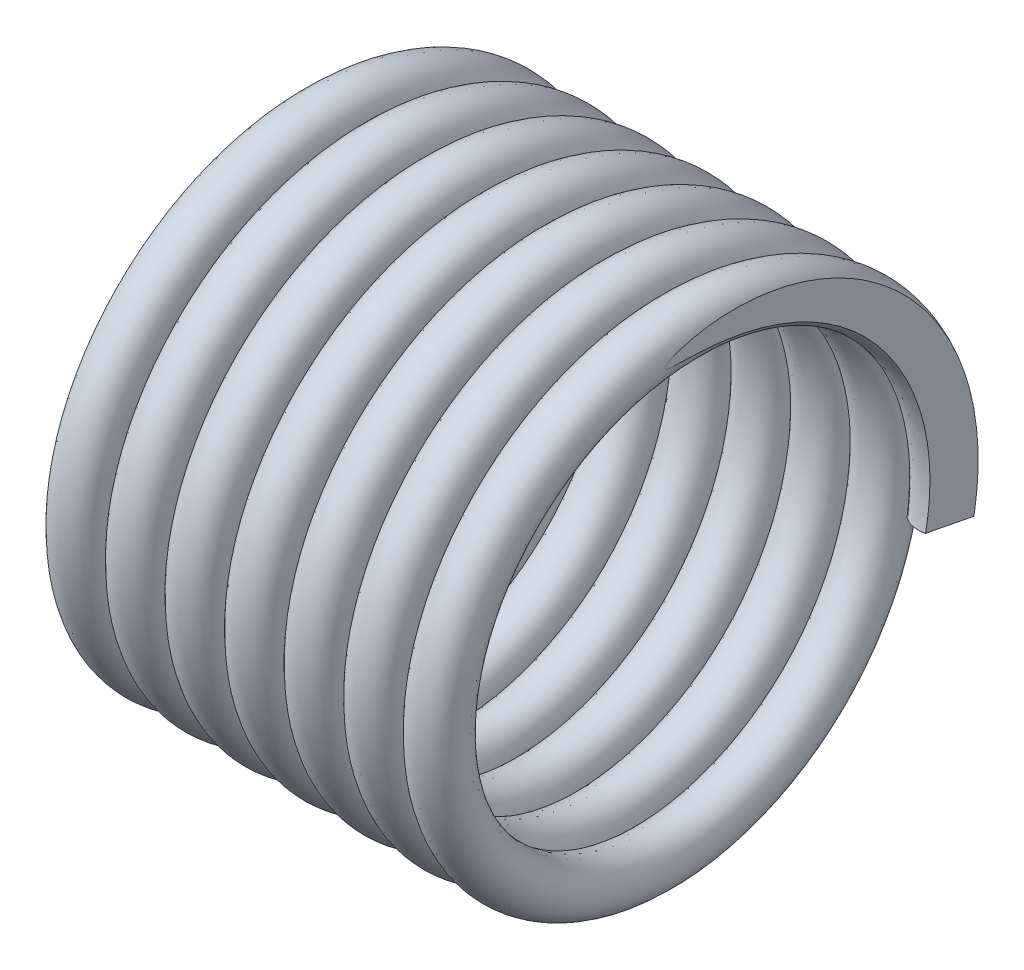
ISO-10303-21;
HEADER;
FILE_DESCRIPTION(('STEP AP214'),'2;1');
FILE_NAME('part.step','',(''),(''),'','','');
FILE_SCHEMA(('AUTOMOTIVE_DESIGN { 1 0 10303 214 1 1 1 1 }'));
ENDSEC;
DATA;
#1=APPLICATION_CONTEXT('core data for automotive mechanical design processes');
#2=APPLICATION_PROTOCOL_DEFINITION('international standard','automotive_design',2000,#1);
#3=PRODUCT_CONTEXT('',#1,'mechanical');
#4=PRODUCT('Part','Part','',(#3));
#5=PRODUCT_RELATED_PRODUCT_CATEGORY('part','',(#4));
#6=PRODUCT_DEFINITION_FORMATION('','',#4);
#7=PRODUCT_DEFINITION_CONTEXT('part definition',#1,'design');
#8=PRODUCT_DEFINITION('design','',#6,#7);
#9=PRODUCT_DEFINITION_SHAPE('','',#8);
#10=(LENGTH_UNIT() NAMED_UNIT(*) SI_UNIT(.MILLI.,.METRE.));
#11=(NAMED_UNIT(*) PLANE_ANGLE_UNIT() SI_UNIT($,.RADIAN.));
#12=(NAMED_UNIT(*) SI_UNIT($,.STERADIAN.) SOLID_ANGLE_UNIT());
#13=UNCERTAINTY_MEASURE_WITH_UNIT(LENGTH_MEASURE(1.E-05),#10,'distance_accuracy_value','');
#14=(GEOMETRIC_REPRESENTATION_CONTEXT(3) GLOBAL_UNCERTAINTY_ASSIGNED_CONTEXT((#13)) GLOBAL_UNIT_ASSIGNED_CONTEXT((#10,
#11,#12)) REPRESENTATION_CONTEXT('',''));
#15=CARTESIAN_POINT('',(0.,0.,0.));
#16=DIRECTION('',(0.,0.,1.));
#17=DIRECTION('',(1.,0.,0.));
#18=AXIS2_PLACEMENT_3D('',#15,#16,#17);
#19=CARTESIAN_POINT('',(4.99894619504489,-0.597390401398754,-3.09242701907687));
#20=DIRECTION('',(0.,-0.98184754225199,0.189671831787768));
#21=DIRECTION('',(0.,-0.189671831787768,-0.98184754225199));
#22=AXIS2_PLACEMENT_3D('',#19,#20,#21);
#23=PLANE('',#22);
#24=CARTESIAN_POINT('',(4.99894619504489,-0.539578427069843,-2.79315988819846));
#25=DIRECTION('',(0.,-0.98184754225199,0.189671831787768));
#26=DIRECTION('',(0.,0.189671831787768,0.98184754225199));
#27=AXIS2_PLACEMENT_3D('',#24,#25,#26);
#28=CIRCLE('',#27,0.3048);
#29=CARTESIAN_POINT('',(5.08000004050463,-0.483844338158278,-2.50464905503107));
#30=VERTEX_POINT('',#29);
#31=CARTESIAN_POINT('',(5.08000162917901,-0.595309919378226,-3.08165727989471));
#32=VERTEX_POINT('',#31);
#33=EDGE_CURVE('E39',#30,#32,#28,.T.);
#34=ORIENTED_EDGE('',*,*,#33,.T.);
#35=DIRECTION('',(0.,0.189671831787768,0.98184754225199));
#36=VECTOR('',#35,1.);
#37=CARTESIAN_POINT('',(5.08,-0.597390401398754,-3.09242701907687));
#38=LINE('',#37,#36);
#39=EDGE_CURVE('E51',#32,#30,#38,.T.);
#40=ORIENTED_EDGE('',*,*,#39,.T.);
#41=EDGE_LOOP('',(#34,#40));
#42=FACE_BOUND('',#41,.T.);
#43=ADVANCED_FACE('F35',(#42),#23,.T.);
#44=CARTESIAN_POINT('',(0.,0.,-2.54));
#45=CARTESIAN_POINT('',(0.0592666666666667,-1.46646968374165,-2.54));
#46=CARTESIAN_POINT('',(0.118533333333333,-2.19970452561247,-1.27));
#47=CARTESIAN_POINT('',(0.1778,-2.9329393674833,0.));
#48=CARTESIAN_POINT('',(0.237066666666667,-2.19970452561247,1.27));
#49=CARTESIAN_POINT('',(0.296333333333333,-1.46646968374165,2.54));
#50=CARTESIAN_POINT('',(0.3556,0.,2.54));
#51=CARTESIAN_POINT('',(0.414866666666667,1.46646968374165,2.54));
#52=CARTESIAN_POINT('',(0.474133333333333,2.19970452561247,1.27));
#53=CARTESIAN_POINT('',(0.5334,2.9329393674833,0.));
#54=CARTESIAN_POINT('',(0.592666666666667,2.19970452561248,-1.27));
#55=CARTESIAN_POINT('',(0.651933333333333,1.46646968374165,-2.54));
#56=CARTESIAN_POINT('',(0.7112,0.,-2.54));
#57=CARTESIAN_POINT('',(0.770466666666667,-1.46646968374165,-2.54));
#58=CARTESIAN_POINT('',(0.829733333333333,-2.19970452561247,-1.27));
#59=CARTESIAN_POINT('',(0.889,-2.9329393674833,0.));
#60=CARTESIAN_POINT('',(0.948266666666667,-2.19970452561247,1.27));
#61=CARTESIAN_POINT('',(1.00753333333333,-1.46646968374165,2.54));
#62=CARTESIAN_POINT('',(1.0668,0.,2.54));
#63=CARTESIAN_POINT('',(1.12606666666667,1.46646968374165,2.54));
#64=CARTESIAN_POINT('',(1.18533333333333,2.19970452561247,1.27));
#65=CARTESIAN_POINT('',(1.2446,2.9329393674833,0.));
#66=CARTESIAN_POINT('',(1.30386666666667,2.19970452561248,-1.27));
#67=CARTESIAN_POINT('',(1.36313333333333,1.46646968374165,-2.54));
#68=CARTESIAN_POINT('',(1.4224,0.,-2.54));
#69=CARTESIAN_POINT('',(1.48166666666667,-1.46646968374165,-2.54));
#70=CARTESIAN_POINT('',(1.54093333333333,-2.19970452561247,-1.27));
#71=CARTESIAN_POINT('',(1.6002,-2.9329393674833,0.));
#72=CARTESIAN_POINT('',(1.65946666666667,-2.19970452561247,1.27));
#73=CARTESIAN_POINT('',(1.71873333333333,-1.46646968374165,2.54));
#74=CARTESIAN_POINT('',(1.778,0.,2.54));
#75=CARTESIAN_POINT('',(1.83726666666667,1.46646968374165,2.54));
#76=CARTESIAN_POINT('',(1.89653333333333,2.19970452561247,1.27));
#77=CARTESIAN_POINT('',(1.9558,2.9329393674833,0.));
#78=CARTESIAN_POINT('',(2.01506666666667,2.19970452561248,-1.27));
#79=CARTESIAN_POINT('',(2.07433333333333,1.46646968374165,-2.54));
#80=CARTESIAN_POINT('',(2.1336,0.,-2.54));
#81=CARTESIAN_POINT('',(2.19286666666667,-1.46646968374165,-2.54));
#82=CARTESIAN_POINT('',(2.25213333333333,-2.19970452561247,-1.27));
#83=CARTESIAN_POINT('',(2.3114,-2.9329393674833,0.));
#84=CARTESIAN_POINT('',(2.37066666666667,-2.19970452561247,1.27));
#85=CARTESIAN_POINT('',(2.42993333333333,-1.46646968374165,2.54));
#86=CARTESIAN_POINT('',(2.4892,0.,2.54));
#87=CARTESIAN_POINT('',(2.54846666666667,1.46646968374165,2.54));
#88=CARTESIAN_POINT('',(2.60773333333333,2.19970452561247,1.27));
#89=CARTESIAN_POINT('',(2.667,2.9329393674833,0.));
#90=CARTESIAN_POINT('',(2.72626666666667,2.19970452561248,-1.27));
#91=CARTESIAN_POINT('',(2.78553333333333,1.46646968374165,-2.54));
#92=CARTESIAN_POINT('',(2.8448,0.,-2.54));
#93=CARTESIAN_POINT('',(2.90406666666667,-1.46646968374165,-2.54));
#94=CARTESIAN_POINT('',(2.96333333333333,-2.19970452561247,-1.27));
#95=CARTESIAN_POINT('',(3.0226,-2.9329393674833,0.));
#96=CARTESIAN_POINT('',(3.08186666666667,-2.19970452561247,1.27));
#97=CARTESIAN_POINT('',(3.14113333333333,-1.46646968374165,2.54));
#98=CARTESIAN_POINT('',(3.2004,0.,2.54));
#99=CARTESIAN_POINT('',(3.25966666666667,1.46646968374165,2.54));
#100=CARTESIAN_POINT('',(3.31893333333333,2.19970452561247,1.27));
#101=CARTESIAN_POINT('',(3.3782,2.9329393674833,0.));
#102=CARTESIAN_POINT('',(3.43746666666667,2.19970452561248,-1.27));
#103=CARTESIAN_POINT('',(3.49673333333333,1.46646968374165,-2.54));
#104=CARTESIAN_POINT('',(3.556,0.,-2.54));
#105=CARTESIAN_POINT('',(3.61526666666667,-1.46646968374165,-2.54));
#106=CARTESIAN_POINT('',(3.67453333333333,-2.19970452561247,-1.27));
#107=CARTESIAN_POINT('',(3.7338,-2.9329393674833,0.));
#108=CARTESIAN_POINT('',(3.79306666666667,-2.19970452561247,1.27));
#109=CARTESIAN_POINT('',(3.85233333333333,-1.46646968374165,2.54));
#110=CARTESIAN_POINT('',(3.9116,0.,2.54));
#111=CARTESIAN_POINT('',(3.97086666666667,1.46646968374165,2.54));
#112=CARTESIAN_POINT('',(4.03013333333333,2.19970452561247,1.27));
#113=CARTESIAN_POINT('',(4.0894,2.9329393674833,0.));
#114=CARTESIAN_POINT('',(4.14866666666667,2.19970452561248,-1.27));
#115=CARTESIAN_POINT('',(4.20793333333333,1.46646968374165,-2.54));
#116=CARTESIAN_POINT('',(4.2672,0.,-2.54));
#117=CARTESIAN_POINT('',(4.32646666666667,-1.46646968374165,-2.54));
#118=CARTESIAN_POINT('',(4.38573333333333,-2.19970452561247,-1.27));
#119=CARTESIAN_POINT('',(4.445,-2.9329393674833,0.));
#120=CARTESIAN_POINT('',(4.50426666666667,-2.19970452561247,1.27));
#121=CARTESIAN_POINT('',(4.56353333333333,-1.46646968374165,2.54));
#122=CARTESIAN_POINT('',(4.6228,0.,2.54));
#123=CARTESIAN_POINT('',(4.68206666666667,1.46646968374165,2.54));
#124=CARTESIAN_POINT('',(4.74133333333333,2.19970452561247,1.27));
#125=CARTESIAN_POINT('',(4.8006,2.9329393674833,0.));
#126=CARTESIAN_POINT('',(4.85986666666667,2.19970452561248,-1.27));
#127=CARTESIAN_POINT('',(4.91913333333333,1.46646968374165,-2.54));
#128=CARTESIAN_POINT('',(4.9784,0.,-2.54));
#129=CARTESIAN_POINT('',(4.98822434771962,-0.243089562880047,-2.54));
#130=CARTESIAN_POINT('',(4.99894619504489,-0.481766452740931,-2.49389275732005));
#131=CARTESIAN_POINT('',(0.6096,0.,-2.54));
#132=CARTESIAN_POINT('',(0.668866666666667,-1.46646968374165,-2.54));
#133=CARTESIAN_POINT('',(0.728133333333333,-2.19970452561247,-1.27));
#134=CARTESIAN_POINT('',(0.7874,-2.9329393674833,0.));
#135=CARTESIAN_POINT('',(0.846666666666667,-2.19970452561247,1.27));
#136=CARTESIAN_POINT('',(0.905933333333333,-1.46646968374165,2.54));
#137=CARTESIAN_POINT('',(0.9652,0.,2.54));
#138=CARTESIAN_POINT('',(1.02446666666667,1.46646968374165,2.54));
#139=CARTESIAN_POINT('',(1.08373333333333,2.19970452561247,1.27));
#140=CARTESIAN_POINT('',(1.143,2.9329393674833,0.));
#141=CARTESIAN_POINT('',(1.20226666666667,2.19970452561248,-1.27));
#142=CARTESIAN_POINT('',(1.26153333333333,1.46646968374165,-2.54));
#143=CARTESIAN_POINT('',(1.3208,0.,-2.54));
#144=CARTESIAN_POINT('',(1.38006666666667,-1.46646968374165,-2.54));
#145=CARTESIAN_POINT('',(1.43933333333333,-2.19970452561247,-1.27));
#146=CARTESIAN_POINT('',(1.4986,-2.9329393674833,0.));
#147=CARTESIAN_POINT('',(1.55786666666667,-2.19970452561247,1.27));
#148=CARTESIAN_POINT('',(1.61713333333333,-1.46646968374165,2.54));
#149=CARTESIAN_POINT('',(1.6764,0.,2.54));
#150=CARTESIAN_POINT('',(1.73566666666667,1.46646968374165,2.54));
#151=CARTESIAN_POINT('',(1.79493333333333,2.19970452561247,1.27));
#152=CARTESIAN_POINT('',(1.8542,2.9329393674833,0.));
#153=CARTESIAN_POINT('',(1.91346666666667,2.19970452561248,-1.27));
#154=CARTESIAN_POINT('',(1.97273333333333,1.46646968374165,-2.54));
#155=CARTESIAN_POINT('',(2.032,0.,-2.54));
#156=CARTESIAN_POINT('',(2.09126666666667,-1.46646968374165,-2.54));
#157=CARTESIAN_POINT('',(2.15053333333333,-2.19970452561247,-1.27));
#158=CARTESIAN_POINT('',(2.2098,-2.9329393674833,0.));
#159=CARTESIAN_POINT('',(2.26906666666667,-2.19970452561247,1.27));
#160=CARTESIAN_POINT('',(2.32833333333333,-1.46646968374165,2.54));
#161=CARTESIAN_POINT('',(2.3876,0.,2.54));
#162=CARTESIAN_POINT('',(2.44686666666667,1.46646968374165,2.54));
#163=CARTESIAN_POINT('',(2.50613333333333,2.19970452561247,1.27));
#164=CARTESIAN_POINT('',(2.5654,2.9329393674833,0.));
#165=CARTESIAN_POINT('',(2.62466666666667,2.19970452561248,-1.27));
#166=CARTESIAN_POINT('',(2.68393333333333,1.46646968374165,-2.54));
#167=CARTESIAN_POINT('',(2.7432,0.,-2.54));
#168=CARTESIAN_POINT('',(2.80246666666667,-1.46646968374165,-2.54));
#169=CARTESIAN_POINT('',(2.86173333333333,-2.19970452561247,-1.27));
#170=CARTESIAN_POINT('',(2.921,-2.9329393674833,0.));
#171=CARTESIAN_POINT('',(2.98026666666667,-2.19970452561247,1.27));
#172=CARTESIAN_POINT('',(3.03953333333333,-1.46646968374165,2.54));
#173=CARTESIAN_POINT('',(3.0988,0.,2.54));
#174=CARTESIAN_POINT('',(3.15806666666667,1.46646968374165,2.54));
#175=CARTESIAN_POINT('',(3.21733333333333,2.19970452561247,1.27));
#176=CARTESIAN_POINT('',(3.2766,2.9329393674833,0.));
#177=CARTESIAN_POINT('',(3.33586666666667,2.19970452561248,-1.27));
#178=CARTESIAN_POINT('',(3.39513333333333,1.46646968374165,-2.54));
#179=CARTESIAN_POINT('',(3.4544,0.,-2.54));
#180=CARTESIAN_POINT('',(3.51366666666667,-1.46646968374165,-2.54));
#181=CARTESIAN_POINT('',(3.57293333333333,-2.19970452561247,-1.27));
#182=CARTESIAN_POINT('',(3.6322,-2.9329393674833,0.));
#183=CARTESIAN_POINT('',(3.69146666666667,-2.19970452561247,1.27));
#184=CARTESIAN_POINT('',(3.75073333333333,-1.46646968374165,2.54));
#185=CARTESIAN_POINT('',(3.81,0.,2.54));
#186=CARTESIAN_POINT('',(3.86926666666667,1.46646968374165,2.54));
#187=CARTESIAN_POINT('',(3.92853333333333,2.19970452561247,1.27));
#188=CARTESIAN_POINT('',(3.9878,2.9329393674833,0.));
#189=CARTESIAN_POINT('',(4.04706666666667,2.19970452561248,-1.27));
#190=CARTESIAN_POINT('',(4.10633333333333,1.46646968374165,-2.54));
#191=CARTESIAN_POINT('',(4.1656,0.,-2.54));
#192=CARTESIAN_POINT('',(4.22486666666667,-1.46646968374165,-2.54));
#193=CARTESIAN_POINT('',(4.28413333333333,-2.19970452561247,-1.27));
#194=CARTESIAN_POINT('',(4.3434,-2.9329393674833,0.));
#195=CARTESIAN_POINT('',(4.40266666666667,-2.19970452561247,1.27));
#196=CARTESIAN_POINT('',(4.46193333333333,-1.46646968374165,2.54));
#197=CARTESIAN_POINT('',(4.5212,0.,2.54));
#198=CARTESIAN_POINT('',(4.58046666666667,1.46646968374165,2.54));
#199=CARTESIAN_POINT('',(4.63973333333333,2.19970452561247,1.27));
#200=CARTESIAN_POINT('',(4.699,2.9329393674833,0.));
#201=CARTESIAN_POINT('',(4.75826666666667,2.19970452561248,-1.27));
#202=CARTESIAN_POINT('',(4.81753333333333,1.46646968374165,-2.54));
#203=CARTESIAN_POINT('',(4.8768,0.,-2.54));
#204=CARTESIAN_POINT('',(4.93606666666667,-1.46646968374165,-2.54));
#205=CARTESIAN_POINT('',(4.99533333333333,-2.19970452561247,-1.27));
#206=CARTESIAN_POINT('',(5.0546,-2.9329393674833,0.));
#207=CARTESIAN_POINT('',(5.11386666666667,-2.19970452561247,1.27));
#208=CARTESIAN_POINT('',(5.17313333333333,-1.46646968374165,2.54));
#209=CARTESIAN_POINT('',(5.2324,0.,2.54));
#210=CARTESIAN_POINT('',(5.29166666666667,1.46646968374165,2.54));
#211=CARTESIAN_POINT('',(5.35093333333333,2.19970452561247,1.27));
#212=CARTESIAN_POINT('',(5.4102,2.9329393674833,0.));
#213=CARTESIAN_POINT('',(5.46946666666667,2.19970452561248,-1.27));
#214=CARTESIAN_POINT('',(5.52873333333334,1.46646968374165,-2.54));
#215=CARTESIAN_POINT('',(5.588,0.,-2.54));
#216=CARTESIAN_POINT('',(5.59782434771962,-0.243089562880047,-2.54));
#217=CARTESIAN_POINT('',(5.60854619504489,-0.481766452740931,-2.49389275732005));
#218=CARTESIAN_POINT('',(0.6096,0.,-3.1496));
#219=CARTESIAN_POINT('',(0.668866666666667,-1.81842240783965,-3.1496));
#220=CARTESIAN_POINT('',(0.728133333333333,-2.72763361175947,-1.5748));
#221=CARTESIAN_POINT('',(0.7874,-3.63684481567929,0.));
#222=CARTESIAN_POINT('',(0.846666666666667,-2.72763361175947,1.5748));
#223=CARTESIAN_POINT('',(0.905933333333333,-1.81842240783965,3.1496));
#224=CARTESIAN_POINT('',(0.9652,0.,3.1496));
#225=CARTESIAN_POINT('',(1.02446666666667,1.81842240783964,3.1496));
#226=CARTESIAN_POINT('',(1.08373333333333,2.72763361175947,1.5748));
#227=CARTESIAN_POINT('',(1.143,3.63684481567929,0.));
#228=CARTESIAN_POINT('',(1.20226666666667,2.72763361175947,-1.5748));
#229=CARTESIAN_POINT('',(1.26153333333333,1.81842240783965,-3.1496));
#230=CARTESIAN_POINT('',(1.3208,0.,-3.1496));
#231=CARTESIAN_POINT('',(1.38006666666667,-1.81842240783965,-3.1496));
#232=CARTESIAN_POINT('',(1.43933333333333,-2.72763361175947,-1.5748));
#233=CARTESIAN_POINT('',(1.4986,-3.63684481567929,0.));
#234=CARTESIAN_POINT('',(1.55786666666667,-2.72763361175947,1.5748));
#235=CARTESIAN_POINT('',(1.61713333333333,-1.81842240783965,3.1496));
#236=CARTESIAN_POINT('',(1.6764,0.,3.1496));
#237=CARTESIAN_POINT('',(1.73566666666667,1.81842240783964,3.1496));
#238=CARTESIAN_POINT('',(1.79493333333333,2.72763361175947,1.5748));
#239=CARTESIAN_POINT('',(1.8542,3.63684481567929,0.));
#240=CARTESIAN_POINT('',(1.91346666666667,2.72763361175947,-1.5748));
#241=CARTESIAN_POINT('',(1.97273333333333,1.81842240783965,-3.1496));
#242=CARTESIAN_POINT('',(2.032,0.,-3.1496));
#243=CARTESIAN_POINT('',(2.09126666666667,-1.81842240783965,-3.1496));
#244=CARTESIAN_POINT('',(2.15053333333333,-2.72763361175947,-1.5748));
#245=CARTESIAN_POINT('',(2.2098,-3.63684481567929,0.));
#246=CARTESIAN_POINT('',(2.26906666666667,-2.72763361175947,1.5748));
#247=CARTESIAN_POINT('',(2.32833333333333,-1.81842240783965,3.1496));
#248=CARTESIAN_POINT('',(2.3876,0.,3.1496));
#249=CARTESIAN_POINT('',(2.44686666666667,1.81842240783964,3.1496));
#250=CARTESIAN_POINT('',(2.50613333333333,2.72763361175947,1.5748));
#251=CARTESIAN_POINT('',(2.5654,3.63684481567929,0.));
#252=CARTESIAN_POINT('',(2.62466666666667,2.72763361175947,-1.5748));
#253=CARTESIAN_POINT('',(2.68393333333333,1.81842240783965,-3.1496));
#254=CARTESIAN_POINT('',(2.7432,0.,-3.1496));
#255=CARTESIAN_POINT('',(2.80246666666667,-1.81842240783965,-3.1496));
#256=CARTESIAN_POINT('',(2.86173333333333,-2.72763361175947,-1.5748));
#257=CARTESIAN_POINT('',(2.921,-3.63684481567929,0.));
#258=CARTESIAN_POINT('',(2.98026666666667,-2.72763361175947,1.5748));
#259=CARTESIAN_POINT('',(3.03953333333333,-1.81842240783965,3.1496));
#260=CARTESIAN_POINT('',(3.0988,0.,3.1496));
#261=CARTESIAN_POINT('',(3.15806666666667,1.81842240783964,3.1496));
#262=CARTESIAN_POINT('',(3.21733333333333,2.72763361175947,1.5748));
#263=CARTESIAN_POINT('',(3.2766,3.63684481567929,0.));
#264=CARTESIAN_POINT('',(3.33586666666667,2.72763361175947,-1.5748));
#265=CARTESIAN_POINT('',(3.39513333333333,1.81842240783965,-3.1496));
#266=CARTESIAN_POINT('',(3.4544,0.,-3.1496));
#267=CARTESIAN_POINT('',(3.51366666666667,-1.81842240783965,-3.1496));
#268=CARTESIAN_POINT('',(3.57293333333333,-2.72763361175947,-1.5748));
#269=CARTESIAN_POINT('',(3.6322,-3.63684481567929,0.));
#270=CARTESIAN_POINT('',(3.69146666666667,-2.72763361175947,1.5748));
#271=CARTESIAN_POINT('',(3.75073333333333,-1.81842240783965,3.1496));
#272=CARTESIAN_POINT('',(3.81,0.,3.1496));
#273=CARTESIAN_POINT('',(3.86926666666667,1.81842240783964,3.1496));
#274=CARTESIAN_POINT('',(3.92853333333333,2.72763361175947,1.5748));
#275=CARTESIAN_POINT('',(3.9878,3.63684481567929,0.));
#276=CARTESIAN_POINT('',(4.04706666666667,2.72763361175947,-1.5748));
#277=CARTESIAN_POINT('',(4.10633333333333,1.81842240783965,-3.1496));
#278=CARTESIAN_POINT('',(4.1656,0.,-3.1496));
#279=CARTESIAN_POINT('',(4.22486666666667,-1.81842240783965,-3.1496));
#280=CARTESIAN_POINT('',(4.28413333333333,-2.72763361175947,-1.5748));
#281=CARTESIAN_POINT('',(4.3434,-3.63684481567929,0.));
#282=CARTESIAN_POINT('',(4.40266666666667,-2.72763361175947,1.5748));
#283=CARTESIAN_POINT('',(4.46193333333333,-1.81842240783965,3.1496));
#284=CARTESIAN_POINT('',(4.5212,0.,3.1496));
#285=CARTESIAN_POINT('',(4.58046666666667,1.81842240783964,3.1496));
#286=CARTESIAN_POINT('',(4.63973333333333,2.72763361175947,1.5748));
#287=CARTESIAN_POINT('',(4.699,3.63684481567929,0.));
#288=CARTESIAN_POINT('',(4.75826666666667,2.72763361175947,-1.5748));
#289=CARTESIAN_POINT('',(4.81753333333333,1.81842240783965,-3.1496));
#290=CARTESIAN_POINT('',(4.8768,0.,-3.1496));
#291=CARTESIAN_POINT('',(4.93606666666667,-1.81842240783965,-3.1496));
#292=CARTESIAN_POINT('',(4.99533333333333,-2.72763361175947,-1.5748));
#293=CARTESIAN_POINT('',(5.0546,-3.63684481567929,0.));
#294=CARTESIAN_POINT('',(5.11386666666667,-2.72763361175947,1.5748));
#295=CARTESIAN_POINT('',(5.17313333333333,-1.81842240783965,3.1496));
#296=CARTESIAN_POINT('',(5.2324,0.,3.1496));
#297=CARTESIAN_POINT('',(5.29166666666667,1.81842240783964,3.1496));
#298=CARTESIAN_POINT('',(5.35093333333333,2.72763361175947,1.5748));
#299=CARTESIAN_POINT('',(5.4102,3.63684481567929,0.));
#300=CARTESIAN_POINT('',(5.46946666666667,2.72763361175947,-1.5748));
#301=CARTESIAN_POINT('',(5.52873333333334,1.81842240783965,-3.1496));
#302=CARTESIAN_POINT('',(5.588,0.,-3.1496));
#303=CARTESIAN_POINT('',(5.59782434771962,-0.301431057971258,-3.1496));
#304=CARTESIAN_POINT('',(5.60854619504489,-0.597390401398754,-3.09242701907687));
#305=CARTESIAN_POINT('',(0.,0.,-3.1496));
#306=CARTESIAN_POINT('',(0.0592666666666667,-1.81842240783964,-3.1496));
#307=CARTESIAN_POINT('',(0.118533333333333,-2.72763361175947,-1.5748));
#308=CARTESIAN_POINT('',(0.1778,-3.63684481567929,0.));
#309=CARTESIAN_POINT('',(0.237066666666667,-2.72763361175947,1.5748));
#310=CARTESIAN_POINT('',(0.296333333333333,-1.81842240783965,3.1496));
#311=CARTESIAN_POINT('',(0.3556,0.,3.1496));
#312=CARTESIAN_POINT('',(0.414866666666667,1.81842240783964,3.1496));
#313=CARTESIAN_POINT('',(0.474133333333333,2.72763361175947,1.5748));
#314=CARTESIAN_POINT('',(0.5334,3.63684481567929,0.));
#315=CARTESIAN_POINT('',(0.592666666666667,2.72763361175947,-1.5748));
#316=CARTESIAN_POINT('',(0.651933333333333,1.81842240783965,-3.1496));
#317=CARTESIAN_POINT('',(0.7112,0.,-3.1496));
#318=CARTESIAN_POINT('',(0.770466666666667,-1.81842240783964,-3.1496));
#319=CARTESIAN_POINT('',(0.829733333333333,-2.72763361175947,-1.5748));
#320=CARTESIAN_POINT('',(0.889,-3.63684481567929,0.));
#321=CARTESIAN_POINT('',(0.948266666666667,-2.72763361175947,1.5748));
#322=CARTESIAN_POINT('',(1.00753333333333,-1.81842240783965,3.1496));
#323=CARTESIAN_POINT('',(1.0668,0.,3.1496));
#324=CARTESIAN_POINT('',(1.12606666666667,1.81842240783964,3.1496));
#325=CARTESIAN_POINT('',(1.18533333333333,2.72763361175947,1.5748));
#326=CARTESIAN_POINT('',(1.2446,3.63684481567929,0.));
#327=CARTESIAN_POINT('',(1.30386666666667,2.72763361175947,-1.5748));
#328=CARTESIAN_POINT('',(1.36313333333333,1.81842240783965,-3.1496));
#329=CARTESIAN_POINT('',(1.4224,0.,-3.1496));
#330=CARTESIAN_POINT('',(1.48166666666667,-1.81842240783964,-3.1496));
#331=CARTESIAN_POINT('',(1.54093333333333,-2.72763361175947,-1.5748));
#332=CARTESIAN_POINT('',(1.6002,-3.63684481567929,0.));
#333=CARTESIAN_POINT('',(1.65946666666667,-2.72763361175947,1.5748));
#334=CARTESIAN_POINT('',(1.71873333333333,-1.81842240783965,3.1496));
#335=CARTESIAN_POINT('',(1.778,0.,3.1496));
#336=CARTESIAN_POINT('',(1.83726666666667,1.81842240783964,3.1496));
#337=CARTESIAN_POINT('',(1.89653333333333,2.72763361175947,1.5748));
#338=CARTESIAN_POINT('',(1.9558,3.63684481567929,0.));
#339=CARTESIAN_POINT('',(2.01506666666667,2.72763361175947,-1.5748));
#340=CARTESIAN_POINT('',(2.07433333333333,1.81842240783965,-3.1496));
#341=CARTESIAN_POINT('',(2.1336,0.,-3.1496));
#342=CARTESIAN_POINT('',(2.19286666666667,-1.81842240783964,-3.1496));
#343=CARTESIAN_POINT('',(2.25213333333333,-2.72763361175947,-1.5748));
#344=CARTESIAN_POINT('',(2.3114,-3.63684481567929,0.));
#345=CARTESIAN_POINT('',(2.37066666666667,-2.72763361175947,1.5748));
#346=CARTESIAN_POINT('',(2.42993333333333,-1.81842240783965,3.1496));
#347=CARTESIAN_POINT('',(2.4892,0.,3.1496));
#348=CARTESIAN_POINT('',(2.54846666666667,1.81842240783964,3.1496));
#349=CARTESIAN_POINT('',(2.60773333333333,2.72763361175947,1.5748));
#350=CARTESIAN_POINT('',(2.667,3.63684481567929,0.));
#351=CARTESIAN_POINT('',(2.72626666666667,2.72763361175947,-1.5748));
#352=CARTESIAN_POINT('',(2.78553333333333,1.81842240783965,-3.1496));
#353=CARTESIAN_POINT('',(2.8448,0.,-3.1496));
#354=CARTESIAN_POINT('',(2.90406666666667,-1.81842240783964,-3.1496));
#355=CARTESIAN_POINT('',(2.96333333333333,-2.72763361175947,-1.5748));
#356=CARTESIAN_POINT('',(3.0226,-3.63684481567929,0.));
#357=CARTESIAN_POINT('',(3.08186666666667,-2.72763361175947,1.5748));
#358=CARTESIAN_POINT('',(3.14113333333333,-1.81842240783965,3.1496));
#359=CARTESIAN_POINT('',(3.2004,0.,3.1496));
#360=CARTESIAN_POINT('',(3.25966666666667,1.81842240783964,3.1496));
#361=CARTESIAN_POINT('',(3.31893333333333,2.72763361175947,1.5748));
#362=CARTESIAN_POINT('',(3.3782,3.63684481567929,0.));
#363=CARTESIAN_POINT('',(3.43746666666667,2.72763361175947,-1.5748));
#364=CARTESIAN_POINT('',(3.49673333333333,1.81842240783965,-3.1496));
#365=CARTESIAN_POINT('',(3.556,0.,-3.1496));
#366=CARTESIAN_POINT('',(3.61526666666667,-1.81842240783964,-3.1496));
#367=CARTESIAN_POINT('',(3.67453333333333,-2.72763361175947,-1.5748));
#368=CARTESIAN_POINT('',(3.7338,-3.63684481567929,0.));
#369=CARTESIAN_POINT('',(3.79306666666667,-2.72763361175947,1.5748));
#370=CARTESIAN_POINT('',(3.85233333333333,-1.81842240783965,3.1496));
#371=CARTESIAN_POINT('',(3.9116,0.,3.1496));
#372=CARTESIAN_POINT('',(3.97086666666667,1.81842240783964,3.1496));
#373=CARTESIAN_POINT('',(4.03013333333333,2.72763361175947,1.5748));
#374=CARTESIAN_POINT('',(4.0894,3.63684481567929,0.));
#375=CARTESIAN_POINT('',(4.14866666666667,2.72763361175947,-1.5748));
#376=CARTESIAN_POINT('',(4.20793333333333,1.81842240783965,-3.1496));
#377=CARTESIAN_POINT('',(4.2672,0.,-3.1496));
#378=CARTESIAN_POINT('',(4.32646666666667,-1.81842240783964,-3.1496));
#379=CARTESIAN_POINT('',(4.38573333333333,-2.72763361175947,-1.5748));
#380=CARTESIAN_POINT('',(4.445,-3.63684481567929,0.));
#381=CARTESIAN_POINT('',(4.50426666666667,-2.72763361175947,1.5748));
#382=CARTESIAN_POINT('',(4.56353333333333,-1.81842240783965,3.1496));
#383=CARTESIAN_POINT('',(4.6228,0.,3.1496));
#384=CARTESIAN_POINT('',(4.68206666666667,1.81842240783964,3.1496));
#385=CARTESIAN_POINT('',(4.74133333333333,2.72763361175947,1.5748));
#386=CARTESIAN_POINT('',(4.8006,3.63684481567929,0.));
#387=CARTESIAN_POINT('',(4.85986666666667,2.72763361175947,-1.5748));
#388=CARTESIAN_POINT('',(4.91913333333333,1.81842240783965,-3.1496));
#389=CARTESIAN_POINT('',(4.9784,0.,-3.1496));
#390=CARTESIAN_POINT('',(4.98822434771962,-0.301431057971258,-3.1496));
#391=CARTESIAN_POINT('',(4.99894619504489,-0.597390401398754,-3.09242701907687));
#392=CARTESIAN_POINT('',(-0.6096,0.,-3.1496));
#393=CARTESIAN_POINT('',(-0.550333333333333,-1.81842240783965,-3.1496));
#394=CARTESIAN_POINT('',(-0.491066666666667,-2.72763361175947,-1.5748));
#395=CARTESIAN_POINT('',(-0.4318,-3.63684481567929,0.));
#396=CARTESIAN_POINT('',(-0.372533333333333,-2.72763361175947,1.5748));
#397=CARTESIAN_POINT('',(-0.313266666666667,-1.81842240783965,3.1496));
#398=CARTESIAN_POINT('',(-0.254,0.,3.1496));
#399=CARTESIAN_POINT('',(-0.194733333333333,1.81842240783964,3.1496));
#400=CARTESIAN_POINT('',(-0.135466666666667,2.72763361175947,1.5748));
#401=CARTESIAN_POINT('',(-0.0761999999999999,3.63684481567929,0.));
#402=CARTESIAN_POINT('',(-0.0169333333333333,2.72763361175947,-1.5748));
#403=CARTESIAN_POINT('',(0.0423333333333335,1.81842240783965,-3.1496));
#404=CARTESIAN_POINT('',(0.1016,0.,-3.1496));
#405=CARTESIAN_POINT('',(0.160866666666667,-1.81842240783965,-3.1496));
#406=CARTESIAN_POINT('',(0.220133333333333,-2.72763361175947,-1.5748));
#407=CARTESIAN_POINT('',(0.2794,-3.63684481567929,0.));
#408=CARTESIAN_POINT('',(0.338666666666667,-2.72763361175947,1.5748));
#409=CARTESIAN_POINT('',(0.397933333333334,-1.81842240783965,3.1496));
#410=CARTESIAN_POINT('',(0.4572,0.,3.1496));
#411=CARTESIAN_POINT('',(0.516466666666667,1.81842240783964,3.1496));
#412=CARTESIAN_POINT('',(0.575733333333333,2.72763361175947,1.5748));
#413=CARTESIAN_POINT('',(0.635,3.63684481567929,0.));
#414=CARTESIAN_POINT('',(0.694266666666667,2.72763361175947,-1.5748));
#415=CARTESIAN_POINT('',(0.753533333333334,1.81842240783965,-3.1496));
#416=CARTESIAN_POINT('',(0.8128,0.,-3.1496));
#417=CARTESIAN_POINT('',(0.872066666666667,-1.81842240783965,-3.1496));
#418=CARTESIAN_POINT('',(0.931333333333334,-2.72763361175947,-1.5748));
#419=CARTESIAN_POINT('',(0.990600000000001,-3.63684481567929,0.));
#420=CARTESIAN_POINT('',(1.04986666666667,-2.72763361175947,1.5748));
#421=CARTESIAN_POINT('',(1.10913333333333,-1.81842240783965,3.1496));
#422=CARTESIAN_POINT('',(1.1684,0.,3.1496));
#423=CARTESIAN_POINT('',(1.22766666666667,1.81842240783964,3.1496));
#424=CARTESIAN_POINT('',(1.28693333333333,2.72763361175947,1.5748));
#425=CARTESIAN_POINT('',(1.3462,3.63684481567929,0.));
#426=CARTESIAN_POINT('',(1.40546666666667,2.72763361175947,-1.5748));
#427=CARTESIAN_POINT('',(1.46473333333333,1.81842240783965,-3.1496));
#428=CARTESIAN_POINT('',(1.524,0.,-3.1496));
#429=CARTESIAN_POINT('',(1.58326666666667,-1.81842240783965,-3.1496));
#430=CARTESIAN_POINT('',(1.64253333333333,-2.72763361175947,-1.5748));
#431=CARTESIAN_POINT('',(1.7018,-3.63684481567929,0.));
#432=CARTESIAN_POINT('',(1.76106666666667,-2.72763361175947,1.5748));
#433=CARTESIAN_POINT('',(1.82033333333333,-1.81842240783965,3.1496));
#434=CARTESIAN_POINT('',(1.8796,0.,3.1496));
#435=CARTESIAN_POINT('',(1.93886666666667,1.81842240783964,3.1496));
#436=CARTESIAN_POINT('',(1.99813333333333,2.72763361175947,1.5748));
#437=CARTESIAN_POINT('',(2.0574,3.63684481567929,0.));
#438=CARTESIAN_POINT('',(2.11666666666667,2.72763361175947,-1.5748));
#439=CARTESIAN_POINT('',(2.17593333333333,1.81842240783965,-3.1496));
#440=CARTESIAN_POINT('',(2.2352,0.,-3.1496));
#441=CARTESIAN_POINT('',(2.29446666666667,-1.81842240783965,-3.1496));
#442=CARTESIAN_POINT('',(2.35373333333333,-2.72763361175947,-1.5748));
#443=CARTESIAN_POINT('',(2.413,-3.63684481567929,0.));
#444=CARTESIAN_POINT('',(2.47226666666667,-2.72763361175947,1.5748));
#445=CARTESIAN_POINT('',(2.53153333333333,-1.81842240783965,3.1496));
#446=CARTESIAN_POINT('',(2.5908,0.,3.1496));
#447=CARTESIAN_POINT('',(2.65006666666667,1.81842240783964,3.1496));
#448=CARTESIAN_POINT('',(2.70933333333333,2.72763361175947,1.5748));
#449=CARTESIAN_POINT('',(2.7686,3.63684481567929,0.));
#450=CARTESIAN_POINT('',(2.82786666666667,2.72763361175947,-1.5748));
#451=CARTESIAN_POINT('',(2.88713333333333,1.81842240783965,-3.1496));
#452=CARTESIAN_POINT('',(2.9464,0.,-3.1496));
#453=CARTESIAN_POINT('',(3.00566666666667,-1.81842240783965,-3.1496));
#454=CARTESIAN_POINT('',(3.06493333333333,-2.72763361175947,-1.5748));
#455=CARTESIAN_POINT('',(3.1242,-3.63684481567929,0.));
#456=CARTESIAN_POINT('',(3.18346666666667,-2.72763361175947,1.5748));
#457=CARTESIAN_POINT('',(3.24273333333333,-1.81842240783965,3.1496));
#458=CARTESIAN_POINT('',(3.302,0.,3.1496));
#459=CARTESIAN_POINT('',(3.36126666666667,1.81842240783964,3.1496));
#460=CARTESIAN_POINT('',(3.42053333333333,2.72763361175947,1.5748));
#461=CARTESIAN_POINT('',(3.4798,3.63684481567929,0.));
#462=CARTESIAN_POINT('',(3.53906666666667,2.72763361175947,-1.5748));
#463=CARTESIAN_POINT('',(3.59833333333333,1.81842240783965,-3.1496));
#464=CARTESIAN_POINT('',(3.6576,0.,-3.1496));
#465=CARTESIAN_POINT('',(3.71686666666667,-1.81842240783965,-3.1496));
#466=CARTESIAN_POINT('',(3.77613333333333,-2.72763361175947,-1.5748));
#467=CARTESIAN_POINT('',(3.8354,-3.63684481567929,0.));
#468=CARTESIAN_POINT('',(3.89466666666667,-2.72763361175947,1.5748));
#469=CARTESIAN_POINT('',(3.95393333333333,-1.81842240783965,3.1496));
#470=CARTESIAN_POINT('',(4.0132,0.,3.1496));
#471=CARTESIAN_POINT('',(4.07246666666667,1.81842240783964,3.1496));
#472=CARTESIAN_POINT('',(4.13173333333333,2.72763361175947,1.5748));
#473=CARTESIAN_POINT('',(4.191,3.63684481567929,0.));
#474=CARTESIAN_POINT('',(4.25026666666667,2.72763361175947,-1.5748));
#475=CARTESIAN_POINT('',(4.30953333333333,1.81842240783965,-3.1496));
#476=CARTESIAN_POINT('',(4.3688,0.,-3.1496));
#477=CARTESIAN_POINT('',(4.37862434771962,-0.301431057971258,-3.1496));
#478=CARTESIAN_POINT('',(4.38934619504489,-0.597390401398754,-3.09242701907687));
#479=CARTESIAN_POINT('',(-0.6096,0.,-2.54));
#480=CARTESIAN_POINT('',(-0.550333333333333,-1.46646968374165,-2.54));
#481=CARTESIAN_POINT('',(-0.491066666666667,-2.19970452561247,-1.27));
#482=CARTESIAN_POINT('',(-0.4318,-2.9329393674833,0.));
#483=CARTESIAN_POINT('',(-0.372533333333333,-2.19970452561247,1.27));
#484=CARTESIAN_POINT('',(-0.313266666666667,-1.46646968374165,2.54));
#485=CARTESIAN_POINT('',(-0.254,0.,2.54));
#486=CARTESIAN_POINT('',(-0.194733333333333,1.46646968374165,2.54));
#487=CARTESIAN_POINT('',(-0.135466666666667,2.19970452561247,1.27));
#488=CARTESIAN_POINT('',(-0.0761999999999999,2.9329393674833,0.));
#489=CARTESIAN_POINT('',(-0.0169333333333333,2.19970452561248,-1.27));
#490=CARTESIAN_POINT('',(0.0423333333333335,1.46646968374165,-2.54));
#491=CARTESIAN_POINT('',(0.1016,0.,-2.54));
#492=CARTESIAN_POINT('',(0.160866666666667,-1.46646968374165,-2.54));
#493=CARTESIAN_POINT('',(0.220133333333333,-2.19970452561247,-1.27));
#494=CARTESIAN_POINT('',(0.2794,-2.9329393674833,0.));
#495=CARTESIAN_POINT('',(0.338666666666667,-2.19970452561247,1.27));
#496=CARTESIAN_POINT('',(0.397933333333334,-1.46646968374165,2.54));
#497=CARTESIAN_POINT('',(0.4572,0.,2.54));
#498=CARTESIAN_POINT('',(0.516466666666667,1.46646968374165,2.54));
#499=CARTESIAN_POINT('',(0.575733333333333,2.19970452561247,1.27));
#500=CARTESIAN_POINT('',(0.635,2.9329393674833,0.));
#501=CARTESIAN_POINT('',(0.694266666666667,2.19970452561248,-1.27));
#502=CARTESIAN_POINT('',(0.753533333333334,1.46646968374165,-2.54));
#503=CARTESIAN_POINT('',(0.8128,0.,-2.54));
#504=CARTESIAN_POINT('',(0.872066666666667,-1.46646968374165,-2.54));
#505=CARTESIAN_POINT('',(0.931333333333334,-2.19970452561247,-1.27));
#506=CARTESIAN_POINT('',(0.990600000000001,-2.9329393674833,0.));
#507=CARTESIAN_POINT('',(1.04986666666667,-2.19970452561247,1.27));
#508=CARTESIAN_POINT('',(1.10913333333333,-1.46646968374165,2.54));
#509=CARTESIAN_POINT('',(1.1684,0.,2.54));
#510=CARTESIAN_POINT('',(1.22766666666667,1.46646968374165,2.54));
#511=CARTESIAN_POINT('',(1.28693333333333,2.19970452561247,1.27));
#512=CARTESIAN_POINT('',(1.3462,2.9329393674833,0.));
#513=CARTESIAN_POINT('',(1.40546666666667,2.19970452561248,-1.27));
#514=CARTESIAN_POINT('',(1.46473333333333,1.46646968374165,-2.54));
#515=CARTESIAN_POINT('',(1.524,0.,-2.54));
#516=CARTESIAN_POINT('',(1.58326666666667,-1.46646968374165,-2.54));
#517=CARTESIAN_POINT('',(1.64253333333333,-2.19970452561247,-1.27));
#518=CARTESIAN_POINT('',(1.7018,-2.9329393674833,0.));
#519=CARTESIAN_POINT('',(1.76106666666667,-2.19970452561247,1.27));
#520=CARTESIAN_POINT('',(1.82033333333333,-1.46646968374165,2.54));
#521=CARTESIAN_POINT('',(1.8796,0.,2.54));
#522=CARTESIAN_POINT('',(1.93886666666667,1.46646968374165,2.54));
#523=CARTESIAN_POINT('',(1.99813333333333,2.19970452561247,1.27));
#524=CARTESIAN_POINT('',(2.0574,2.9329393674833,0.));
#525=CARTESIAN_POINT('',(2.11666666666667,2.19970452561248,-1.27));
#526=CARTESIAN_POINT('',(2.17593333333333,1.46646968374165,-2.54));
#527=CARTESIAN_POINT('',(2.2352,0.,-2.54));
#528=CARTESIAN_POINT('',(2.29446666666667,-1.46646968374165,-2.54));
#529=CARTESIAN_POINT('',(2.35373333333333,-2.19970452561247,-1.27));
#530=CARTESIAN_POINT('',(2.413,-2.9329393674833,0.));
#531=CARTESIAN_POINT('',(2.47226666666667,-2.19970452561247,1.27));
#532=CARTESIAN_POINT('',(2.53153333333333,-1.46646968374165,2.54));
#533=CARTESIAN_POINT('',(2.5908,0.,2.54));
#534=CARTESIAN_POINT('',(2.65006666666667,1.46646968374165,2.54));
#535=CARTESIAN_POINT('',(2.70933333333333,2.19970452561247,1.27));
#536=CARTESIAN_POINT('',(2.7686,2.9329393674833,0.));
#537=CARTESIAN_POINT('',(2.82786666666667,2.19970452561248,-1.27));
#538=CARTESIAN_POINT('',(2.88713333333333,1.46646968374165,-2.54));
#539=CARTESIAN_POINT('',(2.9464,0.,-2.54));
#540=CARTESIAN_POINT('',(3.00566666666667,-1.46646968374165,-2.54));
#541=CARTESIAN_POINT('',(3.06493333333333,-2.19970452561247,-1.27));
#542=CARTESIAN_POINT('',(3.1242,-2.9329393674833,0.));
#543=CARTESIAN_POINT('',(3.18346666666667,-2.19970452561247,1.27));
#544=CARTESIAN_POINT('',(3.24273333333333,-1.46646968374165,2.54));
#545=CARTESIAN_POINT('',(3.302,0.,2.54));
#546=CARTESIAN_POINT('',(3.36126666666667,1.46646968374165,2.54));
#547=CARTESIAN_POINT('',(3.42053333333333,2.19970452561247,1.27));
#548=CARTESIAN_POINT('',(3.4798,2.9329393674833,0.));
#549=CARTESIAN_POINT('',(3.53906666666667,2.19970452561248,-1.27));
#550=CARTESIAN_POINT('',(3.59833333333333,1.46646968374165,-2.54));
#551=CARTESIAN_POINT('',(3.6576,0.,-2.54));
#552=CARTESIAN_POINT('',(3.71686666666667,-1.46646968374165,-2.54));
#553=CARTESIAN_POINT('',(3.77613333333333,-2.19970452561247,-1.27));
#554=CARTESIAN_POINT('',(3.8354,-2.9329393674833,0.));
#555=CARTESIAN_POINT('',(3.89466666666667,-2.19970452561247,1.27));
#556=CARTESIAN_POINT('',(3.95393333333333,-1.46646968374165,2.54));
#557=CARTESIAN_POINT('',(4.0132,0.,2.54));
#558=CARTESIAN_POINT('',(4.07246666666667,1.46646968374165,2.54));
#559=CARTESIAN_POINT('',(4.13173333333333,2.19970452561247,1.27));
#560=CARTESIAN_POINT('',(4.191,2.9329393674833,0.));
#561=CARTESIAN_POINT('',(4.25026666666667,2.19970452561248,-1.27));
#562=CARTESIAN_POINT('',(4.30953333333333,1.46646968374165,-2.54));
#563=CARTESIAN_POINT('',(4.3688,0.,-2.54));
#564=CARTESIAN_POINT('',(4.37862434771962,-0.243089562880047,-2.54));
#565=CARTESIAN_POINT('',(4.38934619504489,-0.481766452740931,-2.49389275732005));
#566=CARTESIAN_POINT('',(0.,0.,-2.54));
#567=CARTESIAN_POINT('',(0.0592666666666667,-1.46646968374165,-2.54));
#568=CARTESIAN_POINT('',(0.118533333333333,-2.19970452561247,-1.27));
#569=CARTESIAN_POINT('',(0.1778,-2.9329393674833,0.));
#570=CARTESIAN_POINT('',(0.237066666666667,-2.19970452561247,1.27));
#571=CARTESIAN_POINT('',(0.296333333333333,-1.46646968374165,2.54));
#572=CARTESIAN_POINT('',(0.3556,0.,2.54));
#573=CARTESIAN_POINT('',(0.414866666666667,1.46646968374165,2.54));
#574=CARTESIAN_POINT('',(0.474133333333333,2.19970452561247,1.27));
#575=CARTESIAN_POINT('',(0.5334,2.9329393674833,0.));
#576=CARTESIAN_POINT('',(0.592666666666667,2.19970452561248,-1.27));
#577=CARTESIAN_POINT('',(0.651933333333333,1.46646968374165,-2.54));
#578=CARTESIAN_POINT('',(0.7112,0.,-2.54));
#579=CARTESIAN_POINT('',(0.770466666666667,-1.46646968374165,-2.54));
#580=CARTESIAN_POINT('',(0.829733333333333,-2.19970452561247,-1.27));
#581=CARTESIAN_POINT('',(0.889,-2.9329393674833,0.));
#582=CARTESIAN_POINT('',(0.948266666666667,-2.19970452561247,1.27));
#583=CARTESIAN_POINT('',(1.00753333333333,-1.46646968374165,2.54));
#584=CARTESIAN_POINT('',(1.0668,0.,2.54));
#585=CARTESIAN_POINT('',(1.12606666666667,1.46646968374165,2.54));
#586=CARTESIAN_POINT('',(1.18533333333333,2.19970452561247,1.27));
#587=CARTESIAN_POINT('',(1.2446,2.9329393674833,0.));
#588=CARTESIAN_POINT('',(1.30386666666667,2.19970452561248,-1.27));
#589=CARTESIAN_POINT('',(1.36313333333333,1.46646968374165,-2.54));
#590=CARTESIAN_POINT('',(1.4224,0.,-2.54));
#591=CARTESIAN_POINT('',(1.48166666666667,-1.46646968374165,-2.54));
#592=CARTESIAN_POINT('',(1.54093333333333,-2.19970452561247,-1.27));
#593=CARTESIAN_POINT('',(1.6002,-2.9329393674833,0.));
#594=CARTESIAN_POINT('',(1.65946666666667,-2.19970452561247,1.27));
#595=CARTESIAN_POINT('',(1.71873333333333,-1.46646968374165,2.54));
#596=CARTESIAN_POINT('',(1.778,0.,2.54));
#597=CARTESIAN_POINT('',(1.83726666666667,1.46646968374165,2.54));
#598=CARTESIAN_POINT('',(1.89653333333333,2.19970452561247,1.27));
#599=CARTESIAN_POINT('',(1.9558,2.9329393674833,0.));
#600=CARTESIAN_POINT('',(2.01506666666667,2.19970452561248,-1.27));
#601=CARTESIAN_POINT('',(2.07433333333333,1.46646968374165,-2.54));
#602=CARTESIAN_POINT('',(2.1336,0.,-2.54));
#603=CARTESIAN_POINT('',(2.19286666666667,-1.46646968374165,-2.54));
#604=CARTESIAN_POINT('',(2.25213333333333,-2.19970452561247,-1.27));
#605=CARTESIAN_POINT('',(2.3114,-2.9329393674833,0.));
#606=CARTESIAN_POINT('',(2.37066666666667,-2.19970452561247,1.27));
#607=CARTESIAN_POINT('',(2.42993333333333,-1.46646968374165,2.54));
#608=CARTESIAN_POINT('',(2.4892,0.,2.54));
#609=CARTESIAN_POINT('',(2.54846666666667,1.46646968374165,2.54));
#610=CARTESIAN_POINT('',(2.60773333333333,2.19970452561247,1.27));
#611=CARTESIAN_POINT('',(2.667,2.9329393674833,0.));
#612=CARTESIAN_POINT('',(2.72626666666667,2.19970452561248,-1.27));
#613=CARTESIAN_POINT('',(2.78553333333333,1.46646968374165,-2.54));
#614=CARTESIAN_POINT('',(2.8448,0.,-2.54));
#615=CARTESIAN_POINT('',(2.90406666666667,-1.46646968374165,-2.54));
#616=CARTESIAN_POINT('',(2.96333333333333,-2.19970452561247,-1.27));
#617=CARTESIAN_POINT('',(3.0226,-2.9329393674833,0.));
#618=CARTESIAN_POINT('',(3.08186666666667,-2.19970452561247,1.27));
#619=CARTESIAN_POINT('',(3.14113333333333,-1.46646968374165,2.54));
#620=CARTESIAN_POINT('',(3.2004,0.,2.54));
#621=CARTESIAN_POINT('',(3.25966666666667,1.46646968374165,2.54));
#622=CARTESIAN_POINT('',(3.31893333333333,2.19970452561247,1.27));
#623=CARTESIAN_POINT('',(3.3782,2.9329393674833,0.));
#624=CARTESIAN_POINT('',(3.43746666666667,2.19970452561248,-1.27));
#625=CARTESIAN_POINT('',(3.49673333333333,1.46646968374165,-2.54));
#626=CARTESIAN_POINT('',(3.556,0.,-2.54));
#627=CARTESIAN_POINT('',(3.61526666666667,-1.46646968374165,-2.54));
#628=CARTESIAN_POINT('',(3.67453333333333,-2.19970452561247,-1.27));
#629=CARTESIAN_POINT('',(3.7338,-2.9329393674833,0.));
#630=CARTESIAN_POINT('',(3.79306666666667,-2.19970452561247,1.27));
#631=CARTESIAN_POINT('',(3.85233333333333,-1.46646968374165,2.54));
#632=CARTESIAN_POINT('',(3.9116,0.,2.54));
#633=CARTESIAN_POINT('',(3.97086666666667,1.46646968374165,2.54));
#634=CARTESIAN_POINT('',(4.03013333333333,2.19970452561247,1.27));
#635=CARTESIAN_POINT('',(4.0894,2.9329393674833,0.));
#636=CARTESIAN_POINT('',(4.14866666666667,2.19970452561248,-1.27));
#637=CARTESIAN_POINT('',(4.20793333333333,1.46646968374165,-2.54));
#638=CARTESIAN_POINT('',(4.2672,0.,-2.54));
#639=CARTESIAN_POINT('',(4.32646666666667,-1.46646968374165,-2.54));
#640=CARTESIAN_POINT('',(4.38573333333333,-2.19970452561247,-1.27));
#641=CARTESIAN_POINT('',(4.445,-2.9329393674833,0.));
#642=CARTESIAN_POINT('',(4.50426666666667,-2.19970452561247,1.27));
#643=CARTESIAN_POINT('',(4.56353333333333,-1.46646968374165,2.54));
#644=CARTESIAN_POINT('',(4.6228,0.,2.54));
#645=CARTESIAN_POINT('',(4.68206666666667,1.46646968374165,2.54));
#646=CARTESIAN_POINT('',(4.74133333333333,2.19970452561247,1.27));
#647=CARTESIAN_POINT('',(4.8006,2.9329393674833,0.));
#648=CARTESIAN_POINT('',(4.85986666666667,2.19970452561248,-1.27));
#649=CARTESIAN_POINT('',(4.91913333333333,1.46646968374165,-2.54));
#650=CARTESIAN_POINT('',(4.9784,0.,-2.54));
#651=CARTESIAN_POINT('',(4.98822434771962,-0.243089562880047,-2.54));
#652=CARTESIAN_POINT('',(4.99894619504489,-0.481766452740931,-2.49389275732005));
#653=(BOUNDED_SURFACE() B_SPLINE_SURFACE(3,2,((#44,#45,#46,#47,#48,#49,#50,#51,#52,#53,#54,#55,
#56,#57,#58,#59,#60,#61,#62,#63,#64,#65,#66,#67,#68,#69,#70,#71,#72,#73,#74,#75,#76,#77,#78,#79,
#80,#81,#82,#83,#84,#85,#86,#87,#88,#89,#90,#91,#92,#93,#94,#95,#96,#97,#98,#99,#100,#101,#102,
#103,#104,#105,#106,#107,#108,#109,#110,#111,#112,#113,#114,#115,#116,#117,#118,#119,#120,#121,
#122,#123,#124,#125,#126,#127,#128,#129,#130),(#131,#132,#133,#134,#135,#136,#137,#138,#139,
#140,#141,#142,#143,#144,#145,#146,#147,#148,#149,#150,#151,#152,#153,#154,#155,#156,#157,#158,
#159,#160,#161,#162,#163,#164,#165,#166,#167,#168,#169,#170,#171,#172,#173,#174,#175,#176,#177,
#178,#179,#180,#181,#182,#183,#184,#185,#186,#187,#188,#189,#190,#191,#192,#193,#194,#195,#196,
#197,#198,#199,#200,#201,#202,#203,#204,#205,#206,#207,#208,#209,#210,#211,#212,#213,#214,#215,
#216,#217),(#218,#219,#220,#221,#222,#223,#224,#225,#226,#227,#228,#229,#230,#231,#232,#233,
#234,#235,#236,#237,#238,#239,#240,#241,#242,#243,#244,#245,#246,#247,#248,#249,#250,#251,#252,
#253,#254,#255,#256,#257,#258,#259,#260,#261,#262,#263,#264,#265,#266,#267,#268,#269,#270,#271,
#272,#273,#274,#275,#276,#277,#278,#279,#280,#281,#282,#283,#284,#285,#286,#287,#288,#289,#290,
#291,#292,#293,#294,#295,#296,#297,#298,#299,#300,#301,#302,#303,#304),(#305,#306,#307,#308,
#309,#310,#311,#312,#313,#314,#315,#316,#317,#318,#319,#320,#321,#322,#323,#324,#325,#326,#327,
#328,#329,#330,#331,#332,#333,#334,#335,#336,#337,#338,#339,#340,#341,#342,#343,#344,#345,#346,
#347,#348,#349,#350,#351,#352,#353,#354,#355,#356,#357,#358,#359,#360,#361,#362,#363,#364,#365,
#366,#367,#368,#369,#370,#371,#372,#373,#374,#375,#376,#377,#378,#379,#380,#381,#382,#383,#384,
#385,#386,#387,#388,#389,#390,#391),(#392,#393,#394,#395,#396,#397,#398,#399,#400,#401,#402,
#403,#404,#405,#406,#407,#408,#409,#410,#411,#412,#413,#414,#415,#416,#417,#418,#419,#420,#421,
#422,#423,#424,#425,#426,#427,#428,#429,#430,#431,#432,#433,#434,#435,#436,#437,#438,#439,#440,
#441,#442,#443,#444,#445,#446,#447,#448,#449,#450,#451,#452,#453,#454,#455,#456,#457,#458,#459,
#460,#461,#462,#463,#464,#465,#466,#467,#468,#469,#470,#471,#472,#473,#474,#475,#476,#477,#478),
(#479,#480,#481,#482,#483,#484,#485,#486,#487,#488,#489,#490,#491,#492,#493,#494,#495,#496,#497,
#498,#499,#500,#501,#502,#503,#504,#505,#506,#507,#508,#509,#510,#511,#512,#513,#514,#515,#516,
#517,#518,#519,#520,#521,#522,#523,#524,#525,#526,#527,#528,#529,#530,#531,#532,#533,#534,#535,
#536,#537,#538,#539,#540,#541,#542,#543,#544,#545,#546,#547,#548,#549,#550,#551,#552,#553,#554,
#555,#556,#557,#558,#559,#560,#561,#562,#563,#564,#565),(#566,#567,#568,#569,#570,#571,#572,
#573,#574,#575,#576,#577,#578,#579,#580,#581,#582,#583,#584,#585,#586,#587,#588,#589,#590,#591,
#592,#593,#594,#595,#596,#597,#598,#599,#600,#601,#602,#603,#604,#605,#606,#607,#608,#609,#610,
#611,#612,#613,#614,#615,#616,#617,#618,#619,#620,#621,#622,#623,#624,#625,#626,#627,#628,#629,
#630,#631,#632,#633,#634,#635,#636,#637,#638,#639,#640,#641,#642,#643,#644,#645,#646,#647,#648,
#649,#650,#651,#652)),.UNSPECIFIED.,.T.,.F.,.F.) B_SPLINE_SURFACE_WITH_KNOTS((4,3,4),(3,2,2,2,2,
2,2,2,2,2,2,2,2,2,2,2,2,2,2,2,2,2,2,2,2,2,2,2,2,2,2,2,2,2,2,2,2,2,2,2,2,2,2,3),(0.,0.5,1.),(0.,
0.0208333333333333,0.0416666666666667,0.0625,0.0833333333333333,0.104166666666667,0.125,
0.145833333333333,0.166666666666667,0.1875,0.208333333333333,0.229166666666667,0.25,
0.270833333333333,0.291666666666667,0.3125,0.333333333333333,0.354166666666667,0.375,
0.395833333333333,0.416666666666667,0.4375,0.458333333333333,0.479166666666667,0.5,
0.520833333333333,0.541666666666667,0.5625,0.583333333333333,0.604166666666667,0.625,
0.645833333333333,0.666666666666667,0.6875,0.708333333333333,0.729166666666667,0.75,
0.770833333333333,0.791666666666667,0.8125,0.833333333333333,0.854166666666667,0.875,
0.878887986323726),
.UNSPECIFIED.) GEOMETRIC_REPRESENTATION_ITEM() RATIONAL_B_SPLINE_SURFACE(((1.,0.866025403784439,
1.,0.866025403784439,1.,0.866025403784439,1.,0.866025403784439,1.,0.866025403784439,1.,
0.866025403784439,1.,0.866025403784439,1.,0.866025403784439,1.,0.866025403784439,1.,
0.866025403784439,1.,0.866025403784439,1.,0.866025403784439,1.,0.866025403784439,1.,
0.866025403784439,1.,0.866025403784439,1.,0.866025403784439,1.,0.866025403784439,1.,
0.866025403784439,1.,0.866025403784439,1.,0.866025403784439,1.,0.866025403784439,1.,
0.866025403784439,1.,0.866025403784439,1.,0.866025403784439,1.,0.866025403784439,1.,
0.866025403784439,1.,0.866025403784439,1.,0.866025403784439,1.,0.866025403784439,1.,
0.866025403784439,1.,0.866025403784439,1.,0.866025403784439,1.,0.866025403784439,1.,
0.866025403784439,1.,0.866025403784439,1.,0.866025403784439,1.,0.866025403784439,1.,
0.866025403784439,1.,0.866025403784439,1.,0.866025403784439,1.,0.866025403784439,1.,
0.866025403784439,1.,0.974997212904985,0.959326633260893),(0.333333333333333,0.288675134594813,
0.333333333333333,0.288675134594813,0.333333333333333,0.288675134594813,0.333333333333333,
0.288675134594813,0.333333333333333,0.288675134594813,0.333333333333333,0.288675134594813,
0.333333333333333,0.288675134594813,0.333333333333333,0.288675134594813,0.333333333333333,
0.288675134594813,0.333333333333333,0.288675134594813,0.333333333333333,0.288675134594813,
0.333333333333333,0.288675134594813,0.333333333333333,0.288675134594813,0.333333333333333,
0.288675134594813,0.333333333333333,0.288675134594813,0.333333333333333,0.288675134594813,
0.333333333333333,0.288675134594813,0.333333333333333,0.288675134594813,0.333333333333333,
0.288675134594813,0.333333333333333,0.288675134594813,0.333333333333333,0.288675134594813,
0.333333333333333,0.288675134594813,0.333333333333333,0.288675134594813,0.333333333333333,
0.288675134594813,0.333333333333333,0.288675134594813,0.333333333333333,0.288675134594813,
0.333333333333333,0.288675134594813,0.333333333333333,0.288675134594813,0.333333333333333,
0.288675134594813,0.333333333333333,0.288675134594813,0.333333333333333,0.288675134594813,
0.333333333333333,0.288675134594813,0.333333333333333,0.288675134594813,0.333333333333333,
0.288675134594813,0.333333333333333,0.288675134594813,0.333333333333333,0.288675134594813,
0.333333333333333,0.288675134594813,0.333333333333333,0.288675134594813,0.333333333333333,
0.288675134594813,0.333333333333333,0.288675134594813,0.333333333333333,0.288675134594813,
0.333333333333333,0.288675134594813,0.333333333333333,0.324999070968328,0.319775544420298),
(0.333333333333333,0.288675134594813,0.333333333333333,0.288675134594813,0.333333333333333,
0.288675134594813,0.333333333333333,0.288675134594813,0.333333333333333,0.288675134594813,
0.333333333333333,0.288675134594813,0.333333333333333,0.288675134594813,0.333333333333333,
0.288675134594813,0.333333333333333,0.288675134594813,0.333333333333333,0.288675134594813,
0.333333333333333,0.288675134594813,0.333333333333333,0.288675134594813,0.333333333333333,
0.288675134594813,0.333333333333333,0.288675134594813,0.333333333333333,0.288675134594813,
0.333333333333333,0.288675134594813,0.333333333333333,0.288675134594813,0.333333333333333,
0.288675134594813,0.333333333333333,0.288675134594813,0.333333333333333,0.288675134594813,
0.333333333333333,0.288675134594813,0.333333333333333,0.288675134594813,0.333333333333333,
0.288675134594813,0.333333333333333,0.288675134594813,0.333333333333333,0.288675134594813,
0.333333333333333,0.288675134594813,0.333333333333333,0.288675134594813,0.333333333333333,
0.288675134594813,0.333333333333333,0.288675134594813,0.333333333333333,0.288675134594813,
0.333333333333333,0.288675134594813,0.333333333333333,0.288675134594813,0.333333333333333,
0.288675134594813,0.333333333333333,0.288675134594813,0.333333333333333,0.288675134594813,
0.333333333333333,0.288675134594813,0.333333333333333,0.288675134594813,0.333333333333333,
0.288675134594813,0.333333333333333,0.288675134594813,0.333333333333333,0.288675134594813,
0.333333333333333,0.288675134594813,0.333333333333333,0.288675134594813,0.333333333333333,
0.324999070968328,0.319775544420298),(1.,0.866025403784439,1.,0.866025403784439,1.,
0.866025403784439,1.,0.866025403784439,1.,0.866025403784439,1.,0.866025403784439,1.,
0.866025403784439,1.,0.866025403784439,1.,0.866025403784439,1.,0.866025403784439,1.,
0.866025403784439,1.,0.866025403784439,1.,0.866025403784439,1.,0.866025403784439,1.,
0.866025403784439,1.,0.866025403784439,1.,0.866025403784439,1.,0.866025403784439,1.,
0.866025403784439,1.,0.866025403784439,1.,0.866025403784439,1.,0.866025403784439,1.,
0.866025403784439,1.,0.866025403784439,1.,0.866025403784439,1.,0.866025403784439,1.,
0.866025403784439,1.,0.866025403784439,1.,0.866025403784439,1.,0.866025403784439,1.,
0.866025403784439,1.,0.866025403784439,1.,0.866025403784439,1.,0.866025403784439,1.,
0.866025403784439,1.,0.866025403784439,1.,0.866025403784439,1.,0.866025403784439,1.,
0.866025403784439,1.,0.866025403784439,1.,0.866025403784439,1.,0.866025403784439,1.,
0.974997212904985,0.959326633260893),(0.333333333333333,0.288675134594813,0.333333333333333,
0.288675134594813,0.333333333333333,0.288675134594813,0.333333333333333,0.288675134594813,
0.333333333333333,0.288675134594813,0.333333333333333,0.288675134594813,0.333333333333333,
0.288675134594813,0.333333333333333,0.288675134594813,0.333333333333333,0.288675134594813,
0.333333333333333,0.288675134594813,0.333333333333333,0.288675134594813,0.333333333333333,
0.288675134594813,0.333333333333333,0.288675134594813,0.333333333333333,0.288675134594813,
0.333333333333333,0.288675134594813,0.333333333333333,0.288675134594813,0.333333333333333,
0.288675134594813,0.333333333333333,0.288675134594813,0.333333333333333,0.288675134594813,
0.333333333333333,0.288675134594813,0.333333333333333,0.288675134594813,0.333333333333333,
0.288675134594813,0.333333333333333,0.288675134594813,0.333333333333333,0.288675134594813,
0.333333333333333,0.288675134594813,0.333333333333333,0.288675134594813,0.333333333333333,
0.288675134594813,0.333333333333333,0.288675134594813,0.333333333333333,0.288675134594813,
0.333333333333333,0.288675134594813,0.333333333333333,0.288675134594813,0.333333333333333,
0.288675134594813,0.333333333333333,0.288675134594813,0.333333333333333,0.288675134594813,
0.333333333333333,0.288675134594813,0.333333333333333,0.288675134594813,0.333333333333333,
0.288675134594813,0.333333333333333,0.288675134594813,0.333333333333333,0.288675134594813,
0.333333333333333,0.288675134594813,0.333333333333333,0.288675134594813,0.333333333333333,
0.288675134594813,0.333333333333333,0.324999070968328,0.319775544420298),(0.333333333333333,
0.288675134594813,0.333333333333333,0.288675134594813,0.333333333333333,0.288675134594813,
0.333333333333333,0.288675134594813,0.333333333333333,0.288675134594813,0.333333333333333,
0.288675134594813,0.333333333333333,0.288675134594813,0.333333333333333,0.288675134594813,
0.333333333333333,0.288675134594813,0.333333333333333,0.288675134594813,0.333333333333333,
0.288675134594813,0.333333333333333,0.288675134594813,0.333333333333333,0.288675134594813,
0.333333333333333,0.288675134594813,0.333333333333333,0.288675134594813,0.333333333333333,
0.288675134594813,0.333333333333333,0.288675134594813,0.333333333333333,0.288675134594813,
0.333333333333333,0.288675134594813,0.333333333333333,0.288675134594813,0.333333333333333,
0.288675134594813,0.333333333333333,0.288675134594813,0.333333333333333,0.288675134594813,
0.333333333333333,0.288675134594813,0.333333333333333,0.288675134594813,0.333333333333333,
0.288675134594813,0.333333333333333,0.288675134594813,0.333333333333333,0.288675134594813,
0.333333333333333,0.288675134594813,0.333333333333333,0.288675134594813,0.333333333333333,
0.288675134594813,0.333333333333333,0.288675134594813,0.333333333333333,0.288675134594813,
0.333333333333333,0.288675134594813,0.333333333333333,0.288675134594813,0.333333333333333,
0.288675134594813,0.333333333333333,0.288675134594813,0.333333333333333,0.288675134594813,
0.333333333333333,0.288675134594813,0.333333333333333,0.288675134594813,0.333333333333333,
0.288675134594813,0.333333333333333,0.288675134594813,0.333333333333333,0.324999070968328,
0.319775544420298),(1.,0.866025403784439,1.,0.866025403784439,1.,0.866025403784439,1.,
0.866025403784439,1.,0.866025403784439,1.,0.866025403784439,1.,0.866025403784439,1.,
0.866025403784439,1.,0.866025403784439,1.,0.866025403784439,1.,0.866025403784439,1.,
0.866025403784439,1.,0.866025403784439,1.,0.866025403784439,1.,0.866025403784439,1.,
0.866025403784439,1.,0.866025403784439,1.,0.866025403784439,1.,0.866025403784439,1.,
0.866025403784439,1.,0.866025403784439,1.,0.866025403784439,1.,0.866025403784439,1.,
0.866025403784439,1.,0.866025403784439,1.,0.866025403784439,1.,0.866025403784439,1.,
0.866025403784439,1.,0.866025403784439,1.,0.866025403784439,1.,0.866025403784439,1.,
0.866025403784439,1.,0.866025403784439,1.,0.866025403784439,1.,0.866025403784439,1.,
0.866025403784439,1.,0.866025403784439,1.,0.866025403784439,1.,0.866025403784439,1.,
0.866025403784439,1.,0.866025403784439,1.,0.866025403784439,1.,0.974997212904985,0.959326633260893))) REPRESENTATION_ITEM('') SURFACE());
#654=CARTESIAN_POINT('',(0.,0.,-2.8448));
#655=DIRECTION('',(0.,1.,0.));
#656=DIRECTION('',(0.,0.,1.));
#657=AXIS2_PLACEMENT_3D('',#654,#655,#656);
#658=CIRCLE('',#657,0.3048);
#659=CARTESIAN_POINT('',(0.,0.,-2.54));
#660=VERTEX_POINT('',#659);
#661=CARTESIAN_POINT('',(0.,0.,-3.1496));
#662=VERTEX_POINT('',#661);
#663=EDGE_CURVE('E72',#660,#662,#658,.T.);
#664=CARTESIAN_POINT('',(0.,0.,-2.54));
#665=CARTESIAN_POINT('',(0.,-0.102294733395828,-2.54003497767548));
#666=CARTESIAN_POINT('',(0.,-0.204605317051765,-2.53390669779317));
#667=CARTESIAN_POINT('',(0.,-0.407904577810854,-2.5095744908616));
#668=CARTESIAN_POINT('',(0.,-0.508891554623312,-2.49135633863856));
#669=CARTESIAN_POINT('',(0.,-0.679225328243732,-2.45005876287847));
#670=CARTESIAN_POINT('',(0.,-0.749293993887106,-2.42989870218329));
#671=CARTESIAN_POINT('',(0.,-0.887489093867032,-2.38374865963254));
#672=CARTESIAN_POINT('',(0.,-0.955615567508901,-2.35775879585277));
#673=CARTESIAN_POINT('',(0.,-1.08944420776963,-2.30013268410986));
#674=CARTESIAN_POINT('',(0.,-1.15514624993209,-2.26849614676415));
#675=CARTESIAN_POINT('',(0.,-1.28370261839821,-2.19978970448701));
#676=CARTESIAN_POINT('',(0.,-1.34655426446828,-2.16271481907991));
#677=CARTESIAN_POINT('',(0.,-1.5300232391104,-2.04377537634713));
#678=CARTESIAN_POINT('',(0.,-1.64571619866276,-1.95412625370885));
#679=CARTESIAN_POINT('',(0.,-1.8603899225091,-1.75667180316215));
#680=CARTESIAN_POINT('',(0.,-1.95937155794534,-1.64886742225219));
#681=CARTESIAN_POINT('',(0.,-2.09314424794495,-1.47595163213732));
#682=CARTESIAN_POINT('',(0.,-2.13530030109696,-1.41641652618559));
#683=CARTESIAN_POINT('',(0.,-2.21443673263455,-1.29399916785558));
#684=CARTESIAN_POINT('',(0.,-2.25141682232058,-1.23111672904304));
#685=CARTESIAN_POINT('',(0.,-2.35434884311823,-1.03821224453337));
#686=CARTESIAN_POINT('',(0.,-2.4123615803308,-0.90384307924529));
#687=CARTESIAN_POINT('',(0.,-2.50605813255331,-0.62591567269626));
#688=CARTESIAN_POINT('',(-3.41164420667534E-13,-2.54148345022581,-0.482271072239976));
#689=CARTESIAN_POINT('',(3.41211533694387E-13,-2.58820822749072,-0.191104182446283));
#690=CARTESIAN_POINT('',(1.27605411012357E-12,-2.59950435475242,-0.0435813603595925));
#691=CARTESIAN_POINT('',(1.23671421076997E-12,-2.59773054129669,0.254162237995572));
#692=CARTESIAN_POINT('',(2.26389467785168E-13,-2.58419951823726,0.404381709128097));
#693=CARTESIAN_POINT('',(-1.13265911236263E-13,-2.54539448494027,0.626287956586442));
#694=CARTESIAN_POINT('',(0.,-2.52936677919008,0.6997087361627));
#695=CARTESIAN_POINT('',(0.,-2.49126393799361,0.844977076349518));
#696=CARTESIAN_POINT('',(0.,-2.46918917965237,0.916824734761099));
#697=CARTESIAN_POINT('',(0.,-2.41890737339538,1.05913616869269));
#698=CARTESIAN_POINT('',(0.,-2.39064255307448,1.12957958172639));
#699=CARTESIAN_POINT('',(0.,-2.34390193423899,1.23326818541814));
#700=CARTESIAN_POINT('',(0.,-2.32759557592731,1.26750568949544));
#701=CARTESIAN_POINT('',(0.,-2.29357559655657,1.3352747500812));
#702=CARTESIAN_POINT('',(0.,-2.27586193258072,1.36880628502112));
#703=CARTESIAN_POINT('',(0.,-2.22079396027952,1.46830265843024));
#704=CARTESIAN_POINT('',(0.,-2.18149676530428,1.53320416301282));
#705=CARTESIAN_POINT('',(0.,-2.09803634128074,1.65978858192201));
#706=CARTESIAN_POINT('',(0.,-2.05387302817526,1.72147144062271));
#707=CARTESIAN_POINT('',(0.,-1.96590014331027,1.83517792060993));
#708=CARTESIAN_POINT('',(0.,-1.92252713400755,1.88754048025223));
#709=CARTESIAN_POINT('',(0.,-1.83256031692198,1.98938898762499));
#710=CARTESIAN_POINT('',(0.,-1.78596742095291,2.03887574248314));
#711=CARTESIAN_POINT('',(0.,-1.68994365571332,2.13505568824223));
#712=CARTESIAN_POINT('',(0.,-1.64051127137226,2.18174736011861));
#713=CARTESIAN_POINT('',(0.,-1.56474416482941,2.24996894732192));
#714=CARTESIAN_POINT('',(0.,-1.53921703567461,2.27240818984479));
#715=CARTESIAN_POINT('',(0.,-1.48775796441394,2.31681835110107));
#716=CARTESIAN_POINT('',(0.,-1.46182600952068,2.33878925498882));
#717=CARTESIAN_POINT('',(0.,-1.42172295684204,2.37251840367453));
#718=CARTESIAN_POINT('',(0.,-1.40760741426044,2.38434332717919));
#719=CARTESIAN_POINT('',(0.,-1.37940483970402,2.40803547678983));
#720=CARTESIAN_POINT('',(0.,-1.36531781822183,2.41990271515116));
#721=CARTESIAN_POINT('',(0.,-1.33733465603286,2.44380393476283));
#722=CARTESIAN_POINT('',(0.,-1.32343816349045,2.45583749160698));
#723=CARTESIAN_POINT('',(0.,-1.30298315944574,2.47431526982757));
#724=CARTESIAN_POINT('',(0.,-1.29623095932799,2.48054461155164));
#725=CARTESIAN_POINT('',(0.,-1.2829533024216,2.49325875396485));
#726=CARTESIAN_POINT('',(0.,-1.27642802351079,2.49974374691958));
#727=CARTESIAN_POINT('',(0.,-1.26682169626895,2.51003590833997));
#728=CARTESIAN_POINT('',(0.,-1.26355932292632,2.51367416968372));
#729=CARTESIAN_POINT('',(0.,-1.25727757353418,2.52115157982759));
#730=CARTESIAN_POINT('',(0.,-1.25425759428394,2.52499018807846));
#731=CARTESIAN_POINT('',(0.,-1.24929449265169,2.53213513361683));
#732=CARTESIAN_POINT('',(-2.06783856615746E-13,-1.24725917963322,2.535379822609));
#733=CARTESIAN_POINT('',(2.08265079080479E-13,-1.24374141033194,2.54226838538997));
#734=CARTESIAN_POINT('',(7.76322326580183E-13,-1.2422629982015,2.5459149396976));
#735=CARTESIAN_POINT('',(-3.32585951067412E-13,-1.24143405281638,2.55139935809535));
#736=CARTESIAN_POINT('',(-9.20641919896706E-13,-1.2413526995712,2.5530924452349));
#737=CARTESIAN_POINT('',(9.29213464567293E-13,-1.24177691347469,2.55644555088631));
#738=CARTESIAN_POINT('',(3.39515646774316E-12,-1.24228791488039,2.55810511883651));
#739=CARTESIAN_POINT('',(3.14827212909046E-12,-1.24383441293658,2.56090004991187));
#740=CARTESIAN_POINT('',(1.00718113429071E-12,-1.24480160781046,2.56207401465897));
#741=CARTESIAN_POINT('',(-1.3941470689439E-12,-1.24748017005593,2.56451439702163));
#742=CARTESIAN_POINT('',(-4.88841375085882E-13,-1.24933351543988,2.5656130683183));
#743=CARTESIAN_POINT('',(9.2696931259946E-13,-1.25494228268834,2.56816296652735));
#744=CARTESIAN_POINT('',(3.56418738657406E-13,-1.2589137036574,2.56904763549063));
#745=CARTESIAN_POINT('',(-6.19992631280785E-13,-1.26985775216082,2.5706073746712));
#746=CARTESIAN_POINT('',(-5.91429183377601E-13,-1.27687617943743,2.57064271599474));
#747=CARTESIAN_POINT('',(5.95271383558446E-13,-1.29089746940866,2.5699544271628));
#748=CARTESIAN_POINT('',(1.76074553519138E-12,-1.29789993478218,2.56922586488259));
#749=CARTESIAN_POINT('',(1.937914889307E-12,-1.31307564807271,2.56713735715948));
#750=CARTESIAN_POINT('',(5.3096653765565E-13,-1.3212362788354,2.56568834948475));
#751=CARTESIAN_POINT('',(-5.31317626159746E-13,-1.33747663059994,2.56238558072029));
#752=CARTESIAN_POINT('',(-1.8549461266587E-13,-1.34555629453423,2.56053155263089));
#753=CARTESIAN_POINT('',(3.71640569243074E-13,-1.36971330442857,2.5545208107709));
#754=CARTESIAN_POINT('',(0.,-1.38567991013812,2.5499203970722));
#755=CARTESIAN_POINT('',(0.,-1.41736682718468,2.53994794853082));
#756=CARTESIAN_POINT('',(0.,-1.43308707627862,2.53457572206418));
#757=CARTESIAN_POINT('',(0.,-1.46428781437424,2.52323343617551));
#758=CARTESIAN_POINT('',(0.,-1.47976857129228,2.51726411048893));
#759=CARTESIAN_POINT('',(0.,-1.52129770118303,2.50046853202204));
#760=CARTESIAN_POINT('',(0.,-1.54715467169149,2.48916839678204));
#761=CARTESIAN_POINT('',(0.,-1.59832071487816,2.46538324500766));
#762=CARTESIAN_POINT('',(0.,-1.62362961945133,2.452897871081));
#763=CARTESIAN_POINT('',(0.,-1.69881806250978,2.41385427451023));
#764=CARTESIAN_POINT('',(0.,-1.74789395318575,2.38573594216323));
#765=CARTESIAN_POINT('',(0.,-1.8438858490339,2.32599698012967));
#766=CARTESIAN_POINT('',(0.,-1.89080050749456,2.29437420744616));
#767=CARTESIAN_POINT('',(0.,-1.98233665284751,2.22802625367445));
#768=CARTESIAN_POINT('',(0.,-2.02695939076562,2.19330279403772));
#769=CARTESIAN_POINT('',(0.,-2.12906060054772,2.10835831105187));
#770=CARTESIAN_POINT('',(0.,-2.18557028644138,2.05696772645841));
#771=CARTESIAN_POINT('',(0.,-2.29403581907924,1.94956122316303));
#772=CARTESIAN_POINT('',(0.,-2.34598979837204,1.89354342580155));
#773=CARTESIAN_POINT('',(0.,-2.44509451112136,1.77739302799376));
#774=CARTESIAN_POINT('',(0.,-2.49224448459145,1.7172597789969));
#775=CARTESIAN_POINT('',(0.,-2.58144431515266,1.59333797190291));
#776=CARTESIAN_POINT('',(0.,-2.62349449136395,1.52954964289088));
#777=CARTESIAN_POINT('',(0.,-2.70293471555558,1.39825235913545));
#778=CARTESIAN_POINT('',(0.,-2.74027330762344,1.33071228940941));
#779=CARTESIAN_POINT('',(0.,-2.80959228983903,1.19295370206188));
#780=CARTESIAN_POINT('',(0.,-2.84157269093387,1.12273518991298));
#781=CARTESIAN_POINT('',(0.,-2.9291711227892,0.908691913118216));
#782=CARTESIAN_POINT('',(0.,-2.97650784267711,0.761377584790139));
#783=CARTESIAN_POINT('',(0.,-3.05094955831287,0.448373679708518));
#784=CARTESIAN_POINT('',(0.,-3.0759726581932,0.282191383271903));
#785=CARTESIAN_POINT('',(0.,-3.09801356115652,-0.0520499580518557));
#786=CARTESIAN_POINT('',(0.,-3.09502591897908,-0.220109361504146));
#787=CARTESIAN_POINT('',(0.,-3.06111100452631,-0.554762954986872));
#788=CARTESIAN_POINT('',(0.,-3.02995640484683,-0.721334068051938));
#789=CARTESIAN_POINT('',(0.,-2.94040555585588,-1.04698465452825));
#790=CARTESIAN_POINT('',(0.,-2.88200829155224,-1.20606384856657));
#791=CARTESIAN_POINT('',(0.,-2.73903005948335,-1.5138551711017));
#792=CARTESIAN_POINT('',(0.,-2.65419950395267,-1.6624511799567));
#793=CARTESIAN_POINT('',(0.,-2.46134939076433,-1.94374363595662));
#794=CARTESIAN_POINT('',(0.,-2.35332756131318,-2.07643852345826));
#795=CARTESIAN_POINT('',(0.,-2.11469849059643,-2.32454651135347));
#796=CARTESIAN_POINT('',(0.,-1.98370766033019,-2.43959121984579));
#797=CARTESIAN_POINT('',(0.,-1.70426909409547,-2.64611774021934));
#798=CARTESIAN_POINT('',(0.,-1.55581796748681,-2.73759496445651));
#799=CARTESIAN_POINT('',(0.,-1.24536047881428,-2.89456124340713));
#800=CARTESIAN_POINT('',(0.,-1.083323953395,-2.95999050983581));
#801=CARTESIAN_POINT('',(0.,-0.750665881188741,-3.06269173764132));
#802=CARTESIAN_POINT('',(0.,-0.580054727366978,-3.09999694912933));
#803=CARTESIAN_POINT('',(0.,-0.340085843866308,-3.13172676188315));
#804=CARTESIAN_POINT('',(0.,-0.27217529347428,-3.13843376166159));
#805=CARTESIAN_POINT('',(0.,-0.136186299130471,-3.14736463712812));
#806=CARTESIAN_POINT('',(0.,-0.0681083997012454,-3.14959679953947));
#807=CARTESIAN_POINT('',(0.,-5.75606379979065E-13,-3.1496));
#808=B_SPLINE_CURVE_WITH_KNOTS('',3,(#664,#665,#666,#667,#668,#669,#670,#671,#672,#673,#674,
#675,#676,#677,#678,#679,#680,#681,#682,#683,#684,#685,#686,#687,#688,#689,#690,#691,#692,#693,
#694,#695,#696,#697,#698,#699,#700,#701,#702,#703,#704,#705,#706,#707,#708,#709,#710,#711,#712,
#713,#714,#715,#716,#717,#718,#719,#720,#721,#722,#723,#724,#725,#726,#727,#728,#729,#730,#731,
#732,#733,#734,#735,#736,#737,#738,#739,#740,#741,#742,#743,#744,#745,#746,#747,#748,#749,#750,
#751,#752,#753,#754,#755,#756,#757,#758,#759,#760,#761,#762,#763,#764,#765,#766,#767,#768,#769,
#770,#771,#772,#773,#774,#775,#776,#777,#778,#779,#780,#781,#782,#783,#784,#785,#786,#787,#788,
#789,#790,#791,#792,#793,#794,#795,#796,#797,#798,#799,#800,#801,#802,#803,#804,#805,#806,#807),
.UNSPECIFIED.,.F.,.F.,(4,2,2,2,2,2,2,2,2,2,2,2,2,2,2,2,2,2,2,2,2,2,2,2,2,2,2,2,2,2,2,2,2,2,2,2,
2,2,2,2,2,2,2,2,2,2,2,2,2,2,2,2,2,2,2,2,2,2,2,2,2,2,2,2,2,2,2,2,2,2,2,4),(0.,0.306738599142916,
0.613838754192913,0.83232956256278,1.05081594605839,1.26931352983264,1.48801247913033,
1.92488903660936,2.36174281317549,2.58035975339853,2.79898888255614,3.23591113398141,
3.67774792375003,4.11964572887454,4.56983352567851,4.79506896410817,5.02029035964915,
5.24771086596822,5.36144886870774,5.47519034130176,5.70255855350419,5.92993069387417,
6.13376758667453,6.33754699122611,6.54143615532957,6.64339368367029,6.74535443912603,
6.80059645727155,6.8558560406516,6.91099401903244,6.93855310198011,6.96613332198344,
6.9807917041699,6.9954123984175,7.00690740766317,7.01848435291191,7.02350724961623,
7.02857659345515,7.03305329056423,7.03940763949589,7.05145712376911,7.07242466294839,
7.09352841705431,7.11837503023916,7.14323807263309,7.19305146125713,7.24287723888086,
7.29264252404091,7.37725767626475,7.46189842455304,7.63139184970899,7.80098949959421,
7.97049357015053,8.19934257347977,8.42828495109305,8.65726349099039,8.88622769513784,
9.11750855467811,9.34878894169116,9.81099677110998,10.3128218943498,10.8147445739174,
11.3207546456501,11.8267835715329,12.3377432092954,12.8487529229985,13.3692914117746,
13.8899311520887,14.4117591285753,14.9329691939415,15.1375759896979,15.3418035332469),.UNSPECIFIED.);
#809=EDGE_CURVE('E45',#660,#662,#808,.T.);
#810=CARTESIAN_POINT('',(5.08,-0.595308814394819,-3.08165155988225));
#811=CARTESIAN_POINT('',(5.07999999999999,-0.49501901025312,-3.10000081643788));
#812=CARTESIAN_POINT('',(5.08,-0.393812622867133,-3.11340441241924));
#813=CARTESIAN_POINT('',(5.08,-0.190374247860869,-3.13023287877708));
#814=CARTESIAN_POINT('',(5.08000000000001,-0.0881406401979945,-3.13363816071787));
#815=CARTESIAN_POINT('',(5.08000000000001,0.100056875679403,-3.13057198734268));
#816=CARTESIAN_POINT('',(5.08,0.186047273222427,-3.12557162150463));
#817=CARTESIAN_POINT('',(5.08,0.357327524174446,-3.10833605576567));
#818=CARTESIAN_POINT('',(5.08,0.442617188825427,-3.09609896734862));
#819=CARTESIAN_POINT('',(5.08,0.611890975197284,-3.06446779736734));
#820=CARTESIAN_POINT('',(5.08,0.695874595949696,-3.04507103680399));
#821=CARTESIAN_POINT('',(5.08,0.861899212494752,-2.99924026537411));
#822=CARTESIAN_POINT('',(5.08,0.943940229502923,-2.97280633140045));
#823=CARTESIAN_POINT('',(5.08,1.10534863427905,-2.91312777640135));
#824=CARTESIAN_POINT('',(5.08,1.18472031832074,-2.87989477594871));
#825=CARTESIAN_POINT('',(5.08,1.34034185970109,-2.80682356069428));
#826=CARTESIAN_POINT('',(5.08,1.41659240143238,-2.76698680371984));
#827=CARTESIAN_POINT('',(5.08,1.56540966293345,-2.68099161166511));
#828=CARTESIAN_POINT('',(5.08,1.63797752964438,-2.63483516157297));
#829=CARTESIAN_POINT('',(5.08,1.77899093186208,-2.53646648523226));
#830=CARTESIAN_POINT('',(5.08,1.84743241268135,-2.48424844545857));
#831=CARTESIAN_POINT('',(5.08,1.97902328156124,-2.37465366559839));
#832=CARTESIAN_POINT('',(5.08,2.04221431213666,-2.31732692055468));
#833=CARTESIAN_POINT('',(5.08,2.16351521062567,-2.19752882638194));
#834=CARTESIAN_POINT('',(5.08,2.22162508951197,-2.13505748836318));
#835=CARTESIAN_POINT('',(5.08,2.33235587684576,-2.00540131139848));
#836=CARTESIAN_POINT('',(5.08,2.38497563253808,-1.93821548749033));
#837=CARTESIAN_POINT('',(5.08,2.48429518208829,-1.79964883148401));
#838=CARTESIAN_POINT('',(5.08,2.53099734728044,-1.72826969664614));
#839=CARTESIAN_POINT('',(5.08,2.61802354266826,-1.58214721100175));
#840=CARTESIAN_POINT('',(5.08,2.65837567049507,-1.50742067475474));
#841=CARTESIAN_POINT('',(5.08,2.73233283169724,-1.35472815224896));
#842=CARTESIAN_POINT('',(5.08,2.76593742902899,-1.27676195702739));
#843=CARTESIAN_POINT('',(5.08,2.8561994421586,-1.03854663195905));
#844=CARTESIAN_POINT('',(5.08,2.90226711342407,-0.874044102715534));
#845=CARTESIAN_POINT('',(5.08,2.9473692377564,-0.6273170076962));
#846=CARTESIAN_POINT('',(5.08,2.9584009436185,-0.547078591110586));
#847=CARTESIAN_POINT('',(5.08,2.97318128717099,-0.385865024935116));
#848=CARTESIAN_POINT('',(5.08,2.97692691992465,-0.304889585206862));
#849=CARTESIAN_POINT('',(5.08,2.97676605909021,-0.143230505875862));
#850=CARTESIAN_POINT('',(5.08,2.9728885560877,-0.0625469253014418));
#851=CARTESIAN_POINT('',(5.08,2.96094512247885,0.0578079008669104));
#852=CARTESIAN_POINT('',(5.08,2.95594613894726,0.0977978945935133));
#853=CARTESIAN_POINT('',(5.08,2.94376787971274,0.177440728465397));
#854=CARTESIAN_POINT('',(5.08000000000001,2.93658915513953,0.217093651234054));
#855=CARTESIAN_POINT('',(5.07999999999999,2.92103502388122,0.290163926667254));
#856=CARTESIAN_POINT('',(5.07999999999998,2.91298536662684,0.32364964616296));
#857=CARTESIAN_POINT('',(5.08000000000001,2.89935669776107,0.373416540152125));
#858=CARTESIAN_POINT('',(5.08000000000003,2.89456004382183,0.389913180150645));
#859=CARTESIAN_POINT('',(5.07999999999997,2.88436770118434,0.422735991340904));
#860=CARTESIAN_POINT('',(5.07999999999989,2.87897159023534,0.439062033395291));
#861=CARTESIAN_POINT('',(5.08,2.86744592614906,0.471469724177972));
#862=CARTESIAN_POINT('',(5.08000000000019,2.86131567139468,0.487551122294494));
#863=CARTESIAN_POINT('',(5.07999999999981,2.84810028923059,0.519312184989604));
#864=CARTESIAN_POINT('',(5.07999999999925,2.84101657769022,0.53499240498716));
#865=CARTESIAN_POINT('',(5.08000000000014,2.82910229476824,0.557900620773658));
#866=CARTESIAN_POINT('',(5.08000000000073,2.82490181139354,0.565455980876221));
#867=CARTESIAN_POINT('',(5.07999999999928,2.81584304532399,0.580147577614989));
#868=CARTESIAN_POINT('',(5.07999999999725,2.81098789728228,0.587285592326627));
#869=CARTESIAN_POINT('',(5.07999999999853,2.80246039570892,0.597341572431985));
#870=CARTESIAN_POINT('',(5.07999999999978,2.79930178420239,0.600668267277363));
#871=CARTESIAN_POINT('',(5.08000000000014,2.7935009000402,0.605376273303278));
#872=CARTESIAN_POINT('',(5.07999999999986,2.79109769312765,0.607022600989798));
#873=CARTESIAN_POINT('',(5.08000000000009,2.78681353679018,0.608962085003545));
#874=CARTESIAN_POINT('',(5.08000000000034,2.78507364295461,0.609531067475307));
#875=CARTESIAN_POINT('',(5.07999999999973,2.78182508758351,0.609958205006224));
#876=CARTESIAN_POINT('',(5.07999999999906,2.7803355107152,0.609931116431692));
#877=CARTESIAN_POINT('',(5.07999999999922,2.77746091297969,0.609345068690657));
#878=CARTESIAN_POINT('',(5.08000000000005,2.77607610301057,0.608785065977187));
#879=CARTESIAN_POINT('',(5.07999999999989,2.77313998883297,0.607038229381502));
#880=CARTESIAN_POINT('',(5.07999999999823,2.77168188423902,0.605706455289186));
#881=CARTESIAN_POINT('',(5.07999999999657,2.76805750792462,0.601557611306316));
#882=CARTESIAN_POINT('',(5.0799999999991,2.76630162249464,0.598422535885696));
#883=CARTESIAN_POINT('',(5.08000000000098,2.76321505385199,0.591677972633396));
#884=CARTESIAN_POINT('',(5.08000000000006,2.76193281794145,0.588050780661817));
#885=CARTESIAN_POINT('',(5.07999999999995,2.75971730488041,0.580686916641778));
#886=CARTESIAN_POINT('',(5.08000000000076,2.75878433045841,0.576950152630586));
#887=CARTESIAN_POINT('',(5.07999999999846,2.75628969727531,0.565612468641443));
#888=CARTESIAN_POINT('',(5.0799999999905,2.75505317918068,0.557945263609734));
#889=CARTESIAN_POINT('',(5.07999999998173,2.75197186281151,0.535189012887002));
#890=CARTESIAN_POINT('',(5.0799999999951,2.7506811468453,0.520034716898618));
#891=CARTESIAN_POINT('',(5.08000000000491,2.74862667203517,0.489679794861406));
#892=CARTESIAN_POINT('',(5.08000000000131,2.74786365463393,0.474479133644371));
#893=CARTESIAN_POINT('',(5.0799999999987,2.74657731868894,0.444158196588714));
#894=CARTESIAN_POINT('',(5.07999999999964,2.74605259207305,0.429037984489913));
#895=CARTESIAN_POINT('',(5.08000000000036,2.74508085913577,0.398804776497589));
#896=CARTESIAN_POINT('',(5.08000000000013,2.74463380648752,0.383691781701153));
#897=CARTESIAN_POINT('',(5.07999999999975,2.74327400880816,0.338270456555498));
#898=CARTESIAN_POINT('',(5.07999999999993,2.74234497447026,0.307962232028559));
#899=CARTESIAN_POINT('',(5.08000000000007,2.7400824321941,0.247361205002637));
#900=CARTESIAN_POINT('',(5.08000000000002,2.73874893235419,0.217068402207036));
#901=CARTESIAN_POINT('',(5.07999999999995,2.73387149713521,0.126231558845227));
#902=CARTESIAN_POINT('',(5.07999999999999,2.72945062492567,0.0657290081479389));
#903=CARTESIAN_POINT('',(5.08000000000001,2.71757489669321,-0.0550967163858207));
#904=CARTESIAN_POINT('',(5.08,2.71011453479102,-0.115419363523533));
#905=CARTESIAN_POINT('',(5.08,2.69187456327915,-0.235579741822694));
#906=CARTESIAN_POINT('',(5.08,2.68109399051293,-0.295417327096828));
#907=CARTESIAN_POINT('',(5.08,2.65142741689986,-0.436359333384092));
#908=CARTESIAN_POINT('',(5.08,2.63101832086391,-0.517149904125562));
#909=CARTESIAN_POINT('',(5.08,2.58352378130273,-0.676755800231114));
#910=CARTESIAN_POINT('',(5.08,2.55643765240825,-0.755570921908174));
#911=CARTESIAN_POINT('',(5.08,2.49558004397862,-0.910655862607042));
#912=CARTESIAN_POINT('',(5.08,2.46180296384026,-0.986923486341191));
#913=CARTESIAN_POINT('',(5.08,2.38770179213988,-1.13622404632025));
#914=CARTESIAN_POINT('',(5.08,2.34737782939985,-1.20925704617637));
#915=CARTESIAN_POINT('',(5.08,2.28232847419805,-1.31560694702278));
#916=CARTESIAN_POINT('',(5.08,2.25997980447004,-1.35039534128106));
#917=CARTESIAN_POINT('',(5.08,2.21368286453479,-1.41889044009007));
#918=CARTESIAN_POINT('',(5.08,2.18973463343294,-1.45259717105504));
#919=CARTESIAN_POINT('',(5.08,2.11559217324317,-1.5519953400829));
#920=CARTESIAN_POINT('',(5.08,2.0630877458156,-1.61598509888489));
#921=CARTESIAN_POINT('',(5.08,1.95241491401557,-1.73878504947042));
#922=CARTESIAN_POINT('',(5.08,1.89424989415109,-1.79759829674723));
#923=CARTESIAN_POINT('',(5.08,1.77274572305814,-1.90958100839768));
#924=CARTESIAN_POINT('',(5.08,1.70940665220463,-1.96275056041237));
#925=CARTESIAN_POINT('',(5.08,1.52392039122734,-2.1042908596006));
#926=CARTESIAN_POINT('',(5.08,1.39627562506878,-2.18561877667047));
#927=CARTESIAN_POINT('',(5.08,1.12909184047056,-2.32549513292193));
#928=CARTESIAN_POINT('',(5.08,0.989550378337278,-2.38403887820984));
#929=CARTESIAN_POINT('',(5.08,0.703525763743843,-2.47625134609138));
#930=CARTESIAN_POINT('',(5.08,0.557096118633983,-2.51008610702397));
#931=CARTESIAN_POINT('',(5.08,0.260710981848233,-2.55243458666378));
#932=CARTESIAN_POINT('',(5.08,0.110760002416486,-2.56097909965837));
#933=CARTESIAN_POINT('',(5.08,-0.113511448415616,-2.55439597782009));
#934=CARTESIAN_POINT('',(5.08,-0.188222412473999,-2.54895544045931));
#935=CARTESIAN_POINT('',(5.08,-0.336777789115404,-2.53162814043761));
#936=CARTESIAN_POINT('',(5.08,-0.410623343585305,-2.51975116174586));
#937=CARTESIAN_POINT('',(5.08,-0.483848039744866,-2.50466821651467));
#938=B_SPLINE_CURVE_WITH_KNOTS('',3,(#810,#811,#812,#813,#814,#815,#816,#817,#818,#819,#820,
#821,#822,#823,#824,#825,#826,#827,#828,#829,#830,#831,#832,#833,#834,#835,#836,#837,#838,#839,
#840,#841,#842,#843,#844,#845,#846,#847,#848,#849,#850,#851,#852,#853,#854,#855,#856,#857,#858,
#859,#860,#861,#862,#863,#864,#865,#866,#867,#868,#869,#870,#871,#872,#873,#874,#875,#876,#877,
#878,#879,#880,#881,#882,#883,#884,#885,#886,#887,#888,#889,#890,#891,#892,#893,#894,#895,#896,
#897,#898,#899,#900,#901,#902,#903,#904,#905,#906,#907,#908,#909,#910,#911,#912,#913,#914,#915,
#916,#917,#918,#919,#920,#921,#922,#923,#924,#925,#926,#927,#928,#929,#930,#931,#932,#933,#934,
#935,#936,#937),.UNSPECIFIED.,.F.,.F.,(4,2,2,2,2,2,2,2,2,2,2,2,2,2,2,2,2,2,2,2,2,2,2,2,2,2,2,2,
2,2,2,2,2,2,2,2,2,2,2,2,2,2,2,2,2,2,2,2,2,2,2,2,2,2,2,2,2,2,2,2,2,2,2,4),(0.,0.305764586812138,
0.612127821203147,0.870239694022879,1.12841895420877,1.38669491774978,1.64496805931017,
1.90280340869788,2.16058191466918,2.41827963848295,2.67622658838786,2.93188008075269,
3.18753302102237,3.44323953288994,3.69884325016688,3.95328208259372,4.20773735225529,
4.71686652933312,4.95960035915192,5.20243427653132,5.44434648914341,5.56520191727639,
5.68602681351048,5.78928431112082,5.84081572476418,5.89238366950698,5.94400129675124,
5.99554310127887,6.02146692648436,6.04727076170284,6.06096854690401,6.06961551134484,
6.0750269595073,6.07940761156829,6.08379685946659,6.08961881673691,6.10025143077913,
6.11178220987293,6.12332296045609,6.14659653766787,6.19219238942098,6.23785217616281,
6.28323852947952,6.32859771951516,6.41956354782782,6.51052755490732,6.69245534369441,
6.87471416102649,7.05702589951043,7.30672013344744,7.55644000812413,7.80636979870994,
8.05629467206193,8.1803026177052,8.30430753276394,8.55224611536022,8.8000373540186,
9.0478247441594,9.49954179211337,9.95135185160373,10.4000971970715,10.8482959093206,
11.0727757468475,11.2969153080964),.UNSPECIFIED.);
#939=EDGE_CURVE('E11',#32,#30,#938,.T.);
#940=ORIENTED_EDGE('',*,*,#663,.F.);
#941=ORIENTED_EDGE('',*,*,#809,.T.);
#942=EDGE_LOOP('',(#940,#941));
#943=FACE_BOUND('',#942,.T.);
#944=ORIENTED_EDGE('',*,*,#939,.F.);
#945=ORIENTED_EDGE('',*,*,#33,.F.);
#946=EDGE_LOOP('',(#944,#945));
#947=FACE_BOUND('',#946,.T.);
#948=ADVANCED_FACE('F71',(#943,#947),#653,.F.);
#949=CARTESIAN_POINT('',(0.,0.,-3.1496));
#950=DIRECTION('',(0.,-1.,0.));
#951=DIRECTION('',(0.,0.,-1.));
#952=AXIS2_PLACEMENT_3D('',#949,#950,#951);
#953=PLANE('',#952);
#954=ORIENTED_EDGE('',*,*,#663,.T.);
#955=DIRECTION('',(0.,0.,1.));
#956=VECTOR('',#955,1.);
#957=CARTESIAN_POINT('',(0.,0.,-3.1496));
#958=LINE('',#957,#956);
#959=EDGE_CURVE('E58',#662,#660,#958,.T.);
#960=ORIENTED_EDGE('',*,*,#959,.T.);
#961=EDGE_LOOP('',(#954,#960));
#962=FACE_BOUND('',#961,.T.);
#963=ADVANCED_FACE('F95',(#962),#953,.F.);
#964=CARTESIAN_POINT('',(0.,0.,0.));
#965=DIRECTION('',(1.,0.,0.));
#966=DIRECTION('',(0.,0.,-1.));
#967=AXIS2_PLACEMENT_3D('',#964,#965,#966);
#968=PLANE('',#967);
#969=ORIENTED_EDGE('',*,*,#809,.F.);
#970=ORIENTED_EDGE('',*,*,#959,.F.);
#971=EDGE_LOOP('',(#969,#970));
#972=FACE_BOUND('',#971,.T.);
#973=ADVANCED_FACE('F97',(#972),#968,.F.);
#974=CARTESIAN_POINT('',(5.08,0.,0.));
#975=DIRECTION('',(1.,0.,0.));
#976=DIRECTION('',(0.,0.,-1.));
#977=AXIS2_PLACEMENT_3D('',#974,#975,#976);
#978=PLANE('',#977);
#979=ORIENTED_EDGE('',*,*,#939,.T.);
#980=ORIENTED_EDGE('',*,*,#39,.F.);
#981=EDGE_LOOP('',(#979,#980));
#982=FACE_BOUND('',#981,.T.);
#983=ADVANCED_FACE('F63',(#982),#978,.T.);
#984=CLOSED_SHELL('',(#43,#948,#963,#973,#983));
#985=MANIFOLD_SOLID_BREP('B2',#984);
#986=ADVANCED_BREP_SHAPE_REPRESENTATION('',(#18,#985),#14);
#987=SHAPE_DEFINITION_REPRESENTATION(#9,#986);
ENDSEC;
END-ISO-10303-21;
